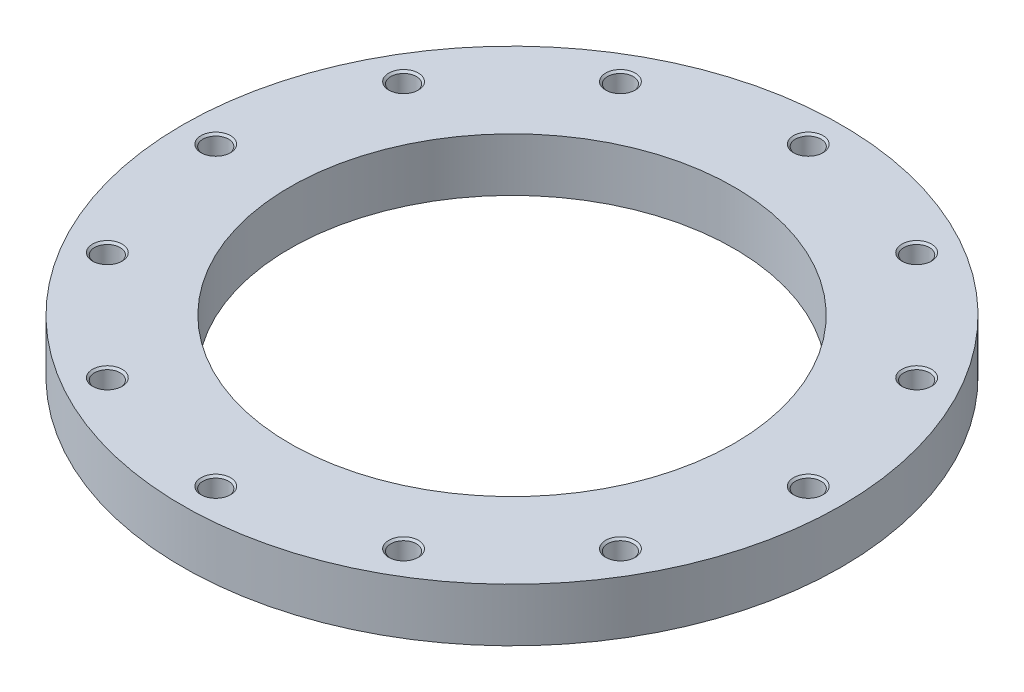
ISO-10303-21;
HEADER;
FILE_DESCRIPTION(('STEP AP214'),'2;1');
FILE_NAME('part.step','',(''),(''),'','','');
FILE_SCHEMA(('AUTOMOTIVE_DESIGN { 1 0 10303 214 1 1 1 1 }'));
ENDSEC;
DATA;
#1=APPLICATION_CONTEXT('core data for automotive mechanical design processes');
#2=APPLICATION_PROTOCOL_DEFINITION('international standard','automotive_design',2000,#1);
#3=PRODUCT_CONTEXT('',#1,'mechanical');
#4=PRODUCT('Part','Part','',(#3));
#5=PRODUCT_RELATED_PRODUCT_CATEGORY('part','',(#4));
#6=PRODUCT_DEFINITION_FORMATION('','',#4);
#7=PRODUCT_DEFINITION_CONTEXT('part definition',#1,'design');
#8=PRODUCT_DEFINITION('design','',#6,#7);
#9=PRODUCT_DEFINITION_SHAPE('','',#8);
#10=(LENGTH_UNIT() NAMED_UNIT(*) SI_UNIT(.MILLI.,.METRE.));
#11=(NAMED_UNIT(*) PLANE_ANGLE_UNIT() SI_UNIT($,.RADIAN.));
#12=(NAMED_UNIT(*) SI_UNIT($,.STERADIAN.) SOLID_ANGLE_UNIT());
#13=UNCERTAINTY_MEASURE_WITH_UNIT(LENGTH_MEASURE(1.E-05),#10,'distance_accuracy_value','');
#14=(GEOMETRIC_REPRESENTATION_CONTEXT(3) GLOBAL_UNCERTAINTY_ASSIGNED_CONTEXT((#13)) GLOBAL_UNIT_ASSIGNED_CONTEXT((#10,
#11,#12)) REPRESENTATION_CONTEXT('',''));
#15=CARTESIAN_POINT('',(0.,0.,0.));
#16=DIRECTION('',(0.,0.,1.));
#17=DIRECTION('',(1.,0.,0.));
#18=AXIS2_PLACEMENT_3D('',#15,#16,#17);
#19=CARTESIAN_POINT('',(0.,18.,0.));
#20=DIRECTION('',(0.,-1.,0.));
#21=DIRECTION('',(1.,0.,0.));
#22=AXIS2_PLACEMENT_3D('',#19,#20,#21);
#23=CYLINDRICAL_SURFACE('',#22,222.5);
#24=CARTESIAN_POINT('',(0.,0.,0.));
#25=DIRECTION('',(0.,1.,0.));
#26=DIRECTION('',(1.,0.,0.));
#27=AXIS2_PLACEMENT_3D('',#24,#25,#26);
#28=CIRCLE('',#27,222.5);
#29=CARTESIAN_POINT('',(222.5,0.,0.));
#30=VERTEX_POINT('',#29);
#31=EDGE_CURVE('E9',#30,#30,#28,.T.);
#32=ORIENTED_EDGE('',*,*,#31,.T.);
#33=EDGE_LOOP('',(#32));
#34=FACE_BOUND('',#33,.T.);
#35=CARTESIAN_POINT('',(0.,36.,0.));
#36=DIRECTION('',(0.,1.,0.));
#37=DIRECTION('',(1.,0.,0.));
#38=AXIS2_PLACEMENT_3D('',#35,#36,#37);
#39=CIRCLE('',#38,222.5);
#40=CARTESIAN_POINT('',(222.5,36.,0.));
#41=VERTEX_POINT('',#40);
#42=EDGE_CURVE('E139',#41,#41,#39,.T.);
#43=ORIENTED_EDGE('',*,*,#42,.F.);
#44=EDGE_LOOP('',(#43));
#45=FACE_BOUND('',#44,.T.);
#46=ADVANCED_FACE('F15',(#34,#45),#23,.T.);
#47=CARTESIAN_POINT('',(186.25,0.,0.));
#48=DIRECTION('',(0.,-1.,0.));
#49=DIRECTION('',(-1.,0.,0.));
#50=AXIS2_PLACEMENT_3D('',#47,#48,#49);
#51=PLANE('',#50);
#52=CARTESIAN_POINT('',(0.,0.,0.));
#53=DIRECTION('',(0.,1.,0.));
#54=DIRECTION('',(1.,0.,0.));
#55=AXIS2_PLACEMENT_3D('',#52,#53,#54);
#56=CIRCLE('',#55,150.);
#57=CARTESIAN_POINT('',(150.,0.,0.));
#58=VERTEX_POINT('',#57);
#59=EDGE_CURVE('E19',#58,#58,#56,.T.);
#60=ORIENTED_EDGE('',*,*,#59,.T.);
#61=EDGE_LOOP('',(#60));
#62=FACE_BOUND('',#61,.T.);
#63=ORIENTED_EDGE('',*,*,#31,.F.);
#64=EDGE_LOOP('',(#63));
#65=FACE_BOUND('',#64,.T.);
#66=ADVANCED_FACE('F17',(#62,#65),#51,.T.);
#67=CARTESIAN_POINT('',(0.,18.,0.));
#68=DIRECTION('',(0.,-1.,0.));
#69=DIRECTION('',(1.,0.,0.));
#70=AXIS2_PLACEMENT_3D('',#67,#68,#69);
#71=CYLINDRICAL_SURFACE('',#70,150.);
#72=CARTESIAN_POINT('',(0.,36.,0.));
#73=DIRECTION('',(0.,1.,0.));
#74=DIRECTION('',(1.,0.,0.));
#75=AXIS2_PLACEMENT_3D('',#72,#73,#74);
#76=CIRCLE('',#75,150.);
#77=CARTESIAN_POINT('',(150.,36.,0.));
#78=VERTEX_POINT('',#77);
#79=EDGE_CURVE('E134',#78,#78,#76,.T.);
#80=ORIENTED_EDGE('',*,*,#79,.T.);
#81=EDGE_LOOP('',(#80));
#82=FACE_BOUND('',#81,.T.);
#83=ORIENTED_EDGE('',*,*,#59,.F.);
#84=EDGE_LOOP('',(#83));
#85=FACE_BOUND('',#84,.T.);
#86=ADVANCED_FACE('F446',(#82,#85),#71,.F.);
#87=CARTESIAN_POINT('',(186.25,36.,0.));
#88=DIRECTION('',(0.,1.,0.));
#89=DIRECTION('',(1.,0.,0.));
#90=AXIS2_PLACEMENT_3D('',#87,#88,#89);
#91=PLANE('',#90);
#92=ORIENTED_EDGE('',*,*,#42,.T.);
#93=EDGE_LOOP('',(#92));
#94=FACE_BOUND('',#93,.T.);
#95=ORIENTED_EDGE('',*,*,#79,.F.);
#96=EDGE_LOOP('',(#95));
#97=FACE_BOUND('',#96,.T.);
#98=CARTESIAN_POINT('',(200.,36.,0.));
#99=DIRECTION('',(0.,-1.,0.));
#100=DIRECTION('',(1.,0.,0.));
#101=AXIS2_PLACEMENT_3D('',#98,#99,#100);
#102=CIRCLE('',#101,10.);
#103=CARTESIAN_POINT('',(210.,36.,0.));
#104=VERTEX_POINT('',#103);
#105=EDGE_CURVE('E339',#104,#104,#102,.T.);
#106=ORIENTED_EDGE('',*,*,#105,.T.);
#107=EDGE_LOOP('',(#106));
#108=FACE_BOUND('',#107,.T.);
#109=CARTESIAN_POINT('',(173.205080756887,36.,-100.));
#110=DIRECTION('',(0.,-1.,0.));
#111=DIRECTION('',(0.866025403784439,0.,-0.5));
#112=AXIS2_PLACEMENT_3D('',#109,#110,#111);
#113=CIRCLE('',#112,10.);
#114=CARTESIAN_POINT('',(181.865334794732,36.,-105.));
#115=VERTEX_POINT('',#114);
#116=EDGE_CURVE('E328',#115,#115,#113,.T.);
#117=ORIENTED_EDGE('',*,*,#116,.T.);
#118=EDGE_LOOP('',(#117));
#119=FACE_BOUND('',#118,.T.);
#120=CARTESIAN_POINT('',(100.,36.,-173.205080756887));
#121=DIRECTION('',(0.,-1.,0.));
#122=DIRECTION('',(0.5,0.,-0.866025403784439));
#123=AXIS2_PLACEMENT_3D('',#120,#121,#122);
#124=CIRCLE('',#123,10.);
#125=CARTESIAN_POINT('',(105.,36.,-181.865334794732));
#126=VERTEX_POINT('',#125);
#127=EDGE_CURVE('E316',#126,#126,#124,.T.);
#128=ORIENTED_EDGE('',*,*,#127,.T.);
#129=EDGE_LOOP('',(#128));
#130=FACE_BOUND('',#129,.T.);
#131=CARTESIAN_POINT('',(0.,36.,-200.));
#132=DIRECTION('',(0.,-1.,0.));
#133=DIRECTION('',(0.,0.,-1.));
#134=AXIS2_PLACEMENT_3D('',#131,#132,#133);
#135=CIRCLE('',#134,10.);
#136=CARTESIAN_POINT('',(0.,36.,-210.));
#137=VERTEX_POINT('',#136);
#138=EDGE_CURVE('E306',#137,#137,#135,.T.);
#139=ORIENTED_EDGE('',*,*,#138,.T.);
#140=EDGE_LOOP('',(#139));
#141=FACE_BOUND('',#140,.T.);
#142=CARTESIAN_POINT('',(-100.,36.,-173.205080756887));
#143=DIRECTION('',(0.,-1.,0.));
#144=DIRECTION('',(-0.5,0.,-0.866025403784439));
#145=AXIS2_PLACEMENT_3D('',#142,#143,#144);
#146=CIRCLE('',#145,10.);
#147=CARTESIAN_POINT('',(-105.,36.,-181.865334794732));
#148=VERTEX_POINT('',#147);
#149=EDGE_CURVE('E291',#148,#148,#146,.T.);
#150=ORIENTED_EDGE('',*,*,#149,.T.);
#151=EDGE_LOOP('',(#150));
#152=FACE_BOUND('',#151,.T.);
#153=CARTESIAN_POINT('',(-173.205080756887,36.,-100.));
#154=DIRECTION('',(0.,-1.,0.));
#155=DIRECTION('',(-0.866025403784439,0.,-0.5));
#156=AXIS2_PLACEMENT_3D('',#153,#154,#155);
#157=CIRCLE('',#156,10.);
#158=CARTESIAN_POINT('',(-181.865334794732,36.,-105.));
#159=VERTEX_POINT('',#158);
#160=EDGE_CURVE('E384',#159,#159,#157,.T.);
#161=ORIENTED_EDGE('',*,*,#160,.T.);
#162=EDGE_LOOP('',(#161));
#163=FACE_BOUND('',#162,.T.);
#164=CARTESIAN_POINT('',(-200.,36.,0.));
#165=DIRECTION('',(0.,-1.,0.));
#166=DIRECTION('',(-1.,0.,0.));
#167=AXIS2_PLACEMENT_3D('',#164,#165,#166);
#168=CIRCLE('',#167,10.);
#169=CARTESIAN_POINT('',(-210.,36.,0.));
#170=VERTEX_POINT('',#169);
#171=EDGE_CURVE('E407',#170,#170,#168,.T.);
#172=ORIENTED_EDGE('',*,*,#171,.T.);
#173=EDGE_LOOP('',(#172));
#174=FACE_BOUND('',#173,.T.);
#175=CARTESIAN_POINT('',(-173.205080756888,36.,100.));
#176=DIRECTION('',(0.,-1.,0.));
#177=DIRECTION('',(-0.866025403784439,0.,0.5));
#178=AXIS2_PLACEMENT_3D('',#175,#176,#177);
#179=CIRCLE('',#178,10.);
#180=CARTESIAN_POINT('',(-181.865334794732,36.,105.));
#181=VERTEX_POINT('',#180);
#182=EDGE_CURVE('E394',#181,#181,#179,.T.);
#183=ORIENTED_EDGE('',*,*,#182,.T.);
#184=EDGE_LOOP('',(#183));
#185=FACE_BOUND('',#184,.T.);
#186=CARTESIAN_POINT('',(-100.,36.,173.205080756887));
#187=DIRECTION('',(0.,-1.,0.));
#188=DIRECTION('',(-0.5,0.,0.866025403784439));
#189=AXIS2_PLACEMENT_3D('',#186,#187,#188);
#190=CIRCLE('',#189,10.);
#191=CARTESIAN_POINT('',(-105.,36.,181.865334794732));
#192=VERTEX_POINT('',#191);
#193=EDGE_CURVE('E379',#192,#192,#190,.T.);
#194=ORIENTED_EDGE('',*,*,#193,.T.);
#195=EDGE_LOOP('',(#194));
#196=FACE_BOUND('',#195,.T.);
#197=CARTESIAN_POINT('',(0.,36.,200.));
#198=DIRECTION('',(0.,-1.,0.));
#199=DIRECTION('',(0.,0.,1.));
#200=AXIS2_PLACEMENT_3D('',#197,#198,#199);
#201=CIRCLE('',#200,10.);
#202=CARTESIAN_POINT('',(0.,36.,210.));
#203=VERTEX_POINT('',#202);
#204=EDGE_CURVE('E359',#203,#203,#201,.T.);
#205=ORIENTED_EDGE('',*,*,#204,.T.);
#206=EDGE_LOOP('',(#205));
#207=FACE_BOUND('',#206,.T.);
#208=CARTESIAN_POINT('',(100.,36.,173.205080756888));
#209=DIRECTION('',(0.,-1.,0.));
#210=DIRECTION('',(0.5,0.,0.866025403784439));
#211=AXIS2_PLACEMENT_3D('',#208,#209,#210);
#212=CIRCLE('',#211,10.);
#213=CARTESIAN_POINT('',(105.,36.,181.865334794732));
#214=VERTEX_POINT('',#213);
#215=EDGE_CURVE('E364',#214,#214,#212,.T.);
#216=ORIENTED_EDGE('',*,*,#215,.T.);
#217=EDGE_LOOP('',(#216));
#218=FACE_BOUND('',#217,.T.);
#219=CARTESIAN_POINT('',(173.205080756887,36.,100.));
#220=DIRECTION('',(0.,-1.,0.));
#221=DIRECTION('',(0.866025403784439,0.,0.5));
#222=AXIS2_PLACEMENT_3D('',#219,#220,#221);
#223=CIRCLE('',#222,10.);
#224=CARTESIAN_POINT('',(181.865334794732,36.,105.));
#225=VERTEX_POINT('',#224);
#226=EDGE_CURVE('E1218',#225,#225,#223,.T.);
#227=ORIENTED_EDGE('',*,*,#226,.T.);
#228=EDGE_LOOP('',(#227));
#229=FACE_BOUND('',#228,.T.);
#230=ADVANCED_FACE('F1128',(#94,#97,#108,#119,#130,#141,#152,#163,#174,#185,#196,#207,#218,
#229),#91,.T.);
#231=CARTESIAN_POINT('',(200.,5.50386219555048,0.));
#232=DIRECTION('',(0.,1.,0.));
#233=DIRECTION('',(1.,0.,0.));
#234=AXIS2_PLACEMENT_3D('',#231,#232,#233);
#235=CONICAL_SURFACE('',#234,4.3234375,1.0471975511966);
#236=CARTESIAN_POINT('',(200.,8.,0.));
#237=DIRECTION('',(0.,-1.,0.));
#238=DIRECTION('',(1.,0.,0.));
#239=AXIS2_PLACEMENT_3D('',#236,#237,#238);
#240=CIRCLE('',#239,8.646875);
#241=CARTESIAN_POINT('',(208.646875,8.,0.));
#242=VERTEX_POINT('',#241);
#243=EDGE_CURVE('E130',#242,#242,#240,.T.);
#244=ORIENTED_EDGE('',*,*,#243,.F.);
#245=EDGE_LOOP('',(#244));
#246=FACE_BOUND('',#245,.T.);
#247=CARTESIAN_POINT('',(200.,3.00772439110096,0.));
#248=VERTEX_POINT('',#247);
#249=VERTEX_LOOP('',#248);
#250=FACE_BOUND('',#249,.T.);
#251=ADVANCED_FACE('F1119',(#246,#250),#235,.F.);
#252=CARTESIAN_POINT('',(200.,11.3234375,0.));
#253=DIRECTION('',(0.,1.,0.));
#254=DIRECTION('',(1.,0.,0.));
#255=AXIS2_PLACEMENT_3D('',#252,#253,#254);
#256=CYLINDRICAL_SURFACE('',#255,8.646875);
#257=CARTESIAN_POINT('',(200.,14.646875,0.));
#258=DIRECTION('',(0.,-1.,0.));
#259=DIRECTION('',(1.,0.,0.));
#260=AXIS2_PLACEMENT_3D('',#257,#258,#259);
#261=CIRCLE('',#260,8.646875);
#262=CARTESIAN_POINT('',(208.646875,14.646875,0.));
#263=VERTEX_POINT('',#262);
#264=EDGE_CURVE('E345',#263,#263,#261,.T.);
#265=ORIENTED_EDGE('',*,*,#264,.F.);
#266=EDGE_LOOP('',(#265));
#267=FACE_BOUND('',#266,.T.);
#268=ORIENTED_EDGE('',*,*,#243,.T.);
#269=EDGE_LOOP('',(#268));
#270=FACE_BOUND('',#269,.T.);
#271=ADVANCED_FACE('F1110',(#267,#270),#256,.F.);
#272=CARTESIAN_POINT('',(200.,15.3234375,0.));
#273=DIRECTION('',(0.,1.,0.));
#274=DIRECTION('',(1.,0.,0.));
#275=AXIS2_PLACEMENT_3D('',#272,#273,#274);
#276=CONICAL_SURFACE('',#275,9.3234375,0.785398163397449);
#277=CARTESIAN_POINT('',(200.,16.,0.));
#278=DIRECTION('',(0.,-1.,0.));
#279=DIRECTION('',(1.,0.,0.));
#280=AXIS2_PLACEMENT_3D('',#277,#278,#279);
#281=CIRCLE('',#280,10.);
#282=CARTESIAN_POINT('',(210.,16.,0.));
#283=VERTEX_POINT('',#282);
#284=EDGE_CURVE('E343',#283,#283,#281,.T.);
#285=ORIENTED_EDGE('',*,*,#284,.F.);
#286=EDGE_LOOP('',(#285));
#287=FACE_BOUND('',#286,.T.);
#288=ORIENTED_EDGE('',*,*,#264,.T.);
#289=EDGE_LOOP('',(#288));
#290=FACE_BOUND('',#289,.T.);
#291=ADVANCED_FACE('F1101',(#287,#290),#276,.F.);
#292=CARTESIAN_POINT('',(209.3234375,16.,0.));
#293=DIRECTION('',(0.,1.,0.));
#294=DIRECTION('',(-1.,0.,0.));
#295=AXIS2_PLACEMENT_3D('',#292,#293,#294);
#296=PLANE('',#295);
#297=CARTESIAN_POINT('',(200.,16.,0.));
#298=DIRECTION('',(0.,-1.,0.));
#299=DIRECTION('',(1.,0.,0.));
#300=AXIS2_PLACEMENT_3D('',#297,#298,#299);
#301=CIRCLE('',#300,8.646875);
#302=CARTESIAN_POINT('',(208.646875,16.,0.));
#303=VERTEX_POINT('',#302);
#304=EDGE_CURVE('E341',#303,#303,#301,.T.);
#305=ORIENTED_EDGE('',*,*,#304,.F.);
#306=EDGE_LOOP('',(#305));
#307=FACE_BOUND('',#306,.T.);
#308=ORIENTED_EDGE('',*,*,#284,.T.);
#309=EDGE_LOOP('',(#308));
#310=FACE_BOUND('',#309,.T.);
#311=ADVANCED_FACE('F1092',(#307,#310),#296,.F.);
#312=CARTESIAN_POINT('',(200.,25.3234375,0.));
#313=DIRECTION('',(0.,1.,0.));
#314=DIRECTION('',(1.,0.,0.));
#315=AXIS2_PLACEMENT_3D('',#312,#313,#314);
#316=CYLINDRICAL_SURFACE('',#315,8.646875);
#317=CARTESIAN_POINT('',(200.,34.646875,0.));
#318=DIRECTION('',(0.,-1.,0.));
#319=DIRECTION('',(1.,0.,0.));
#320=AXIS2_PLACEMENT_3D('',#317,#318,#319);
#321=CIRCLE('',#320,8.646875);
#322=CARTESIAN_POINT('',(208.646875,34.646875,0.));
#323=VERTEX_POINT('',#322);
#324=EDGE_CURVE('E338',#323,#323,#321,.T.);
#325=ORIENTED_EDGE('',*,*,#324,.F.);
#326=EDGE_LOOP('',(#325));
#327=FACE_BOUND('',#326,.T.);
#328=ORIENTED_EDGE('',*,*,#304,.T.);
#329=EDGE_LOOP('',(#328));
#330=FACE_BOUND('',#329,.T.);
#331=ADVANCED_FACE('F1083',(#327,#330),#316,.F.);
#332=CARTESIAN_POINT('',(200.,35.3234375,0.));
#333=DIRECTION('',(0.,1.,0.));
#334=DIRECTION('',(1.,0.,0.));
#335=AXIS2_PLACEMENT_3D('',#332,#333,#334);
#336=CONICAL_SURFACE('',#335,9.3234375,0.785398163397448);
#337=ORIENTED_EDGE('',*,*,#105,.F.);
#338=EDGE_LOOP('',(#337));
#339=FACE_BOUND('',#338,.T.);
#340=ORIENTED_EDGE('',*,*,#324,.T.);
#341=EDGE_LOOP('',(#340));
#342=FACE_BOUND('',#341,.T.);
#343=ADVANCED_FACE('F1074',(#339,#342),#336,.F.);
#344=CARTESIAN_POINT('',(173.205080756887,5.50386219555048,-100.));
#345=DIRECTION('',(0.,1.,0.));
#346=DIRECTION('',(0.866025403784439,0.,-0.5));
#347=AXIS2_PLACEMENT_3D('',#344,#345,#346);
#348=CONICAL_SURFACE('',#347,4.3234375,1.0471975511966);
#349=CARTESIAN_POINT('',(173.205080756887,8.,-100.));
#350=DIRECTION('',(0.,-1.,0.));
#351=DIRECTION('',(0.866025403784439,0.,-0.5));
#352=AXIS2_PLACEMENT_3D('',#349,#350,#351);
#353=CIRCLE('',#352,8.646875);
#354=CARTESIAN_POINT('',(180.693494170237,8.,-104.3234375));
#355=VERTEX_POINT('',#354);
#356=EDGE_CURVE('E336',#355,#355,#353,.T.);
#357=ORIENTED_EDGE('',*,*,#356,.F.);
#358=EDGE_LOOP('',(#357));
#359=FACE_BOUND('',#358,.T.);
#360=CARTESIAN_POINT('',(173.205080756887,3.00772439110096,-100.));
#361=VERTEX_POINT('',#360);
#362=VERTEX_LOOP('',#361);
#363=FACE_BOUND('',#362,.T.);
#364=ADVANCED_FACE('F1065',(#359,#363),#348,.F.);
#365=CARTESIAN_POINT('',(173.205080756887,11.3234375,-100.));
#366=DIRECTION('',(0.,1.,0.));
#367=DIRECTION('',(0.866025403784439,0.,-0.5));
#368=AXIS2_PLACEMENT_3D('',#365,#366,#367);
#369=CYLINDRICAL_SURFACE('',#368,8.646875);
#370=CARTESIAN_POINT('',(173.205080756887,14.646875,-100.));
#371=DIRECTION('',(0.,-1.,0.));
#372=DIRECTION('',(0.866025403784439,0.,-0.5));
#373=AXIS2_PLACEMENT_3D('',#370,#371,#372);
#374=CIRCLE('',#373,8.646875);
#375=CARTESIAN_POINT('',(180.693494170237,14.646875,-104.3234375));
#376=VERTEX_POINT('',#375);
#377=EDGE_CURVE('E334',#376,#376,#374,.T.);
#378=ORIENTED_EDGE('',*,*,#377,.F.);
#379=EDGE_LOOP('',(#378));
#380=FACE_BOUND('',#379,.T.);
#381=ORIENTED_EDGE('',*,*,#356,.T.);
#382=EDGE_LOOP('',(#381));
#383=FACE_BOUND('',#382,.T.);
#384=ADVANCED_FACE('F1056',(#380,#383),#369,.F.);
#385=CARTESIAN_POINT('',(173.205080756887,15.3234375,-100.));
#386=DIRECTION('',(0.,1.,0.));
#387=DIRECTION('',(0.866025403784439,0.,-0.5));
#388=AXIS2_PLACEMENT_3D('',#385,#386,#387);
#389=CONICAL_SURFACE('',#388,9.3234375,0.785398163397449);
#390=CARTESIAN_POINT('',(173.205080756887,16.,-100.));
#391=DIRECTION('',(0.,-1.,0.));
#392=DIRECTION('',(0.866025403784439,0.,-0.5));
#393=AXIS2_PLACEMENT_3D('',#390,#391,#392);
#394=CIRCLE('',#393,10.);
#395=CARTESIAN_POINT('',(181.865334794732,16.,-105.));
#396=VERTEX_POINT('',#395);
#397=EDGE_CURVE('E332',#396,#396,#394,.T.);
#398=ORIENTED_EDGE('',*,*,#397,.F.);
#399=EDGE_LOOP('',(#398));
#400=FACE_BOUND('',#399,.T.);
#401=ORIENTED_EDGE('',*,*,#377,.T.);
#402=EDGE_LOOP('',(#401));
#403=FACE_BOUND('',#402,.T.);
#404=ADVANCED_FACE('F1047',(#400,#403),#389,.F.);
#405=CARTESIAN_POINT('',(181.279414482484,16.,-104.66171875));
#406=DIRECTION('',(0.,1.,0.));
#407=DIRECTION('',(-0.866025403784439,0.,0.5));
#408=AXIS2_PLACEMENT_3D('',#405,#406,#407);
#409=PLANE('',#408);
#410=CARTESIAN_POINT('',(173.205080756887,16.,-100.));
#411=DIRECTION('',(0.,-1.,0.));
#412=DIRECTION('',(0.866025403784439,0.,-0.5));
#413=AXIS2_PLACEMENT_3D('',#410,#411,#412);
#414=CIRCLE('',#413,8.646875);
#415=CARTESIAN_POINT('',(180.693494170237,16.,-104.3234375));
#416=VERTEX_POINT('',#415);
#417=EDGE_CURVE('E330',#416,#416,#414,.T.);
#418=ORIENTED_EDGE('',*,*,#417,.F.);
#419=EDGE_LOOP('',(#418));
#420=FACE_BOUND('',#419,.T.);
#421=ORIENTED_EDGE('',*,*,#397,.T.);
#422=EDGE_LOOP('',(#421));
#423=FACE_BOUND('',#422,.T.);
#424=ADVANCED_FACE('F1038',(#420,#423),#409,.F.);
#425=CARTESIAN_POINT('',(173.205080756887,25.3234375,-100.));
#426=DIRECTION('',(0.,1.,0.));
#427=DIRECTION('',(0.866025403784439,0.,-0.5));
#428=AXIS2_PLACEMENT_3D('',#425,#426,#427);
#429=CYLINDRICAL_SURFACE('',#428,8.646875);
#430=CARTESIAN_POINT('',(173.205080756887,34.646875,-100.));
#431=DIRECTION('',(0.,-1.,0.));
#432=DIRECTION('',(0.866025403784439,0.,-0.5));
#433=AXIS2_PLACEMENT_3D('',#430,#431,#432);
#434=CIRCLE('',#433,8.646875);
#435=CARTESIAN_POINT('',(180.693494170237,34.646875,-104.3234375));
#436=VERTEX_POINT('',#435);
#437=EDGE_CURVE('E326',#436,#436,#434,.T.);
#438=ORIENTED_EDGE('',*,*,#437,.F.);
#439=EDGE_LOOP('',(#438));
#440=FACE_BOUND('',#439,.T.);
#441=ORIENTED_EDGE('',*,*,#417,.T.);
#442=EDGE_LOOP('',(#441));
#443=FACE_BOUND('',#442,.T.);
#444=ADVANCED_FACE('F1029',(#440,#443),#429,.F.);
#445=CARTESIAN_POINT('',(173.205080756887,35.3234375,-100.));
#446=DIRECTION('',(0.,1.,0.));
#447=DIRECTION('',(0.866025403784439,0.,-0.5));
#448=AXIS2_PLACEMENT_3D('',#445,#446,#447);
#449=CONICAL_SURFACE('',#448,9.3234375,0.785398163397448);
#450=ORIENTED_EDGE('',*,*,#116,.F.);
#451=EDGE_LOOP('',(#450));
#452=FACE_BOUND('',#451,.T.);
#453=ORIENTED_EDGE('',*,*,#437,.T.);
#454=EDGE_LOOP('',(#453));
#455=FACE_BOUND('',#454,.T.);
#456=ADVANCED_FACE('F1020',(#452,#455),#449,.F.);
#457=CARTESIAN_POINT('',(100.,5.50386219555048,-173.205080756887));
#458=DIRECTION('',(0.,1.,0.));
#459=DIRECTION('',(0.5,0.,-0.866025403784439));
#460=AXIS2_PLACEMENT_3D('',#457,#458,#459);
#461=CONICAL_SURFACE('',#460,4.3234375,1.0471975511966);
#462=CARTESIAN_POINT('',(100.,8.,-173.205080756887));
#463=DIRECTION('',(0.,-1.,0.));
#464=DIRECTION('',(0.5,0.,-0.866025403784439));
#465=AXIS2_PLACEMENT_3D('',#462,#463,#464);
#466=CIRCLE('',#465,8.646875);
#467=CARTESIAN_POINT('',(104.3234375,8.,-180.693494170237));
#468=VERTEX_POINT('',#467);
#469=EDGE_CURVE('E324',#468,#468,#466,.T.);
#470=ORIENTED_EDGE('',*,*,#469,.F.);
#471=EDGE_LOOP('',(#470));
#472=FACE_BOUND('',#471,.T.);
#473=CARTESIAN_POINT('',(100.,3.00772439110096,-173.205080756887));
#474=VERTEX_POINT('',#473);
#475=VERTEX_LOOP('',#474);
#476=FACE_BOUND('',#475,.T.);
#477=ADVANCED_FACE('F1011',(#472,#476),#461,.F.);
#478=CARTESIAN_POINT('',(100.,11.3234375,-173.205080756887));
#479=DIRECTION('',(0.,1.,0.));
#480=DIRECTION('',(0.5,0.,-0.866025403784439));
#481=AXIS2_PLACEMENT_3D('',#478,#479,#480);
#482=CYLINDRICAL_SURFACE('',#481,8.646875);
#483=CARTESIAN_POINT('',(100.,14.646875,-173.205080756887));
#484=DIRECTION('',(0.,-1.,0.));
#485=DIRECTION('',(0.5,0.,-0.866025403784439));
#486=AXIS2_PLACEMENT_3D('',#483,#484,#485);
#487=CIRCLE('',#486,8.646875);
#488=CARTESIAN_POINT('',(104.3234375,14.646875,-180.693494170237));
#489=VERTEX_POINT('',#488);
#490=EDGE_CURVE('E322',#489,#489,#487,.T.);
#491=ORIENTED_EDGE('',*,*,#490,.F.);
#492=EDGE_LOOP('',(#491));
#493=FACE_BOUND('',#492,.T.);
#494=ORIENTED_EDGE('',*,*,#469,.T.);
#495=EDGE_LOOP('',(#494));
#496=FACE_BOUND('',#495,.T.);
#497=ADVANCED_FACE('F1002',(#493,#496),#482,.F.);
#498=CARTESIAN_POINT('',(100.,15.3234375,-173.205080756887));
#499=DIRECTION('',(0.,1.,0.));
#500=DIRECTION('',(0.5,0.,-0.866025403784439));
#501=AXIS2_PLACEMENT_3D('',#498,#499,#500);
#502=CONICAL_SURFACE('',#501,9.3234375,0.785398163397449);
#503=CARTESIAN_POINT('',(100.,16.,-173.205080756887));
#504=DIRECTION('',(0.,-1.,0.));
#505=DIRECTION('',(0.5,0.,-0.866025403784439));
#506=AXIS2_PLACEMENT_3D('',#503,#504,#505);
#507=CIRCLE('',#506,10.);
#508=CARTESIAN_POINT('',(105.,16.,-181.865334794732));
#509=VERTEX_POINT('',#508);
#510=EDGE_CURVE('E320',#509,#509,#507,.T.);
#511=ORIENTED_EDGE('',*,*,#510,.F.);
#512=EDGE_LOOP('',(#511));
#513=FACE_BOUND('',#512,.T.);
#514=ORIENTED_EDGE('',*,*,#490,.T.);
#515=EDGE_LOOP('',(#514));
#516=FACE_BOUND('',#515,.T.);
#517=ADVANCED_FACE('F993',(#513,#516),#502,.F.);
#518=CARTESIAN_POINT('',(104.66171875,16.,-181.279414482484));
#519=DIRECTION('',(0.,1.,0.));
#520=DIRECTION('',(-0.5,0.,0.866025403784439));
#521=AXIS2_PLACEMENT_3D('',#518,#519,#520);
#522=PLANE('',#521);
#523=CARTESIAN_POINT('',(100.,16.,-173.205080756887));
#524=DIRECTION('',(0.,-1.,0.));
#525=DIRECTION('',(0.5,0.,-0.866025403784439));
#526=AXIS2_PLACEMENT_3D('',#523,#524,#525);
#527=CIRCLE('',#526,8.646875);
#528=CARTESIAN_POINT('',(104.3234375,16.,-180.693494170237));
#529=VERTEX_POINT('',#528);
#530=EDGE_CURVE('E318',#529,#529,#527,.T.);
#531=ORIENTED_EDGE('',*,*,#530,.F.);
#532=EDGE_LOOP('',(#531));
#533=FACE_BOUND('',#532,.T.);
#534=ORIENTED_EDGE('',*,*,#510,.T.);
#535=EDGE_LOOP('',(#534));
#536=FACE_BOUND('',#535,.T.);
#537=ADVANCED_FACE('F984',(#533,#536),#522,.F.);
#538=CARTESIAN_POINT('',(100.,25.3234375,-173.205080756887));
#539=DIRECTION('',(0.,1.,0.));
#540=DIRECTION('',(0.5,0.,-0.866025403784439));
#541=AXIS2_PLACEMENT_3D('',#538,#539,#540);
#542=CYLINDRICAL_SURFACE('',#541,8.646875);
#543=CARTESIAN_POINT('',(100.,34.646875,-173.205080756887));
#544=DIRECTION('',(0.,-1.,0.));
#545=DIRECTION('',(0.5,0.,-0.866025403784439));
#546=AXIS2_PLACEMENT_3D('',#543,#544,#545);
#547=CIRCLE('',#546,8.646875);
#548=CARTESIAN_POINT('',(104.3234375,34.646875,-180.693494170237));
#549=VERTEX_POINT('',#548);
#550=EDGE_CURVE('E314',#549,#549,#547,.T.);
#551=ORIENTED_EDGE('',*,*,#550,.F.);
#552=EDGE_LOOP('',(#551));
#553=FACE_BOUND('',#552,.T.);
#554=ORIENTED_EDGE('',*,*,#530,.T.);
#555=EDGE_LOOP('',(#554));
#556=FACE_BOUND('',#555,.T.);
#557=ADVANCED_FACE('F975',(#553,#556),#542,.F.);
#558=CARTESIAN_POINT('',(100.,35.3234375,-173.205080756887));
#559=DIRECTION('',(0.,1.,0.));
#560=DIRECTION('',(0.5,0.,-0.866025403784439));
#561=AXIS2_PLACEMENT_3D('',#558,#559,#560);
#562=CONICAL_SURFACE('',#561,9.3234375,0.785398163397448);
#563=ORIENTED_EDGE('',*,*,#127,.F.);
#564=EDGE_LOOP('',(#563));
#565=FACE_BOUND('',#564,.T.);
#566=ORIENTED_EDGE('',*,*,#550,.T.);
#567=EDGE_LOOP('',(#566));
#568=FACE_BOUND('',#567,.T.);
#569=ADVANCED_FACE('F966',(#565,#568),#562,.F.);
#570=CARTESIAN_POINT('',(0.,5.50386219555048,-200.));
#571=DIRECTION('',(0.,1.,0.));
#572=DIRECTION('',(0.,0.,-1.));
#573=AXIS2_PLACEMENT_3D('',#570,#571,#572);
#574=CONICAL_SURFACE('',#573,4.3234375,1.0471975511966);
#575=CARTESIAN_POINT('',(0.,8.,-200.));
#576=DIRECTION('',(0.,-1.,0.));
#577=DIRECTION('',(0.,0.,-1.));
#578=AXIS2_PLACEMENT_3D('',#575,#576,#577);
#579=CIRCLE('',#578,8.646875);
#580=CARTESIAN_POINT('',(0.,8.,-208.646875));
#581=VERTEX_POINT('',#580);
#582=EDGE_CURVE('E313',#581,#581,#579,.T.);
#583=ORIENTED_EDGE('',*,*,#582,.F.);
#584=EDGE_LOOP('',(#583));
#585=FACE_BOUND('',#584,.T.);
#586=CARTESIAN_POINT('',(0.,3.00772439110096,-200.));
#587=VERTEX_POINT('',#586);
#588=VERTEX_LOOP('',#587);
#589=FACE_BOUND('',#588,.T.);
#590=ADVANCED_FACE('F480',(#585,#589),#574,.F.);
#591=CARTESIAN_POINT('',(0.,11.3234375,-200.));
#592=DIRECTION('',(0.,1.,0.));
#593=DIRECTION('',(0.,0.,-1.));
#594=AXIS2_PLACEMENT_3D('',#591,#592,#593);
#595=CYLINDRICAL_SURFACE('',#594,8.646875);
#596=CARTESIAN_POINT('',(0.,14.646875,-200.));
#597=DIRECTION('',(0.,-1.,0.));
#598=DIRECTION('',(0.,0.,-1.));
#599=AXIS2_PLACEMENT_3D('',#596,#597,#598);
#600=CIRCLE('',#599,8.646875);
#601=CARTESIAN_POINT('',(0.,14.646875,-208.646875));
#602=VERTEX_POINT('',#601);
#603=EDGE_CURVE('E311',#602,#602,#600,.T.);
#604=ORIENTED_EDGE('',*,*,#603,.F.);
#605=EDGE_LOOP('',(#604));
#606=FACE_BOUND('',#605,.T.);
#607=ORIENTED_EDGE('',*,*,#582,.T.);
#608=EDGE_LOOP('',(#607));
#609=FACE_BOUND('',#608,.T.);
#610=ADVANCED_FACE('F476',(#606,#609),#595,.F.);
#611=CARTESIAN_POINT('',(0.,15.3234375,-200.));
#612=DIRECTION('',(0.,1.,0.));
#613=DIRECTION('',(0.,0.,-1.));
#614=AXIS2_PLACEMENT_3D('',#611,#612,#613);
#615=CONICAL_SURFACE('',#614,9.3234375,0.785398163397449);
#616=CARTESIAN_POINT('',(0.,16.,-200.));
#617=DIRECTION('',(0.,-1.,0.));
#618=DIRECTION('',(0.,0.,-1.));
#619=AXIS2_PLACEMENT_3D('',#616,#617,#618);
#620=CIRCLE('',#619,10.);
#621=CARTESIAN_POINT('',(0.,16.,-210.));
#622=VERTEX_POINT('',#621);
#623=EDGE_CURVE('E309',#622,#622,#620,.T.);
#624=ORIENTED_EDGE('',*,*,#623,.F.);
#625=EDGE_LOOP('',(#624));
#626=FACE_BOUND('',#625,.T.);
#627=ORIENTED_EDGE('',*,*,#603,.T.);
#628=EDGE_LOOP('',(#627));
#629=FACE_BOUND('',#628,.T.);
#630=ADVANCED_FACE('F479',(#626,#629),#615,.F.);
#631=CARTESIAN_POINT('',(0.,16.,-209.3234375));
#632=DIRECTION('',(0.,1.,0.));
#633=DIRECTION('',(0.,0.,1.));
#634=AXIS2_PLACEMENT_3D('',#631,#632,#633);
#635=PLANE('',#634);
#636=CARTESIAN_POINT('',(0.,16.,-200.));
#637=DIRECTION('',(0.,-1.,0.));
#638=DIRECTION('',(0.,0.,-1.));
#639=AXIS2_PLACEMENT_3D('',#636,#637,#638);
#640=CIRCLE('',#639,8.646875);
#641=CARTESIAN_POINT('',(0.,16.,-208.646875));
#642=VERTEX_POINT('',#641);
#643=EDGE_CURVE('E307',#642,#642,#640,.T.);
#644=ORIENTED_EDGE('',*,*,#643,.F.);
#645=EDGE_LOOP('',(#644));
#646=FACE_BOUND('',#645,.T.);
#647=ORIENTED_EDGE('',*,*,#623,.T.);
#648=EDGE_LOOP('',(#647));
#649=FACE_BOUND('',#648,.T.);
#650=ADVANCED_FACE('F936',(#646,#649),#635,.F.);
#651=CARTESIAN_POINT('',(0.,25.3234375,-200.));
#652=DIRECTION('',(0.,1.,0.));
#653=DIRECTION('',(0.,0.,-1.));
#654=AXIS2_PLACEMENT_3D('',#651,#652,#653);
#655=CYLINDRICAL_SURFACE('',#654,8.646875);
#656=CARTESIAN_POINT('',(0.,34.646875,-200.));
#657=DIRECTION('',(0.,-1.,0.));
#658=DIRECTION('',(0.,0.,-1.));
#659=AXIS2_PLACEMENT_3D('',#656,#657,#658);
#660=CIRCLE('',#659,8.646875);
#661=CARTESIAN_POINT('',(0.,34.646875,-208.646875));
#662=VERTEX_POINT('',#661);
#663=EDGE_CURVE('E304',#662,#662,#660,.T.);
#664=ORIENTED_EDGE('',*,*,#663,.F.);
#665=EDGE_LOOP('',(#664));
#666=FACE_BOUND('',#665,.T.);
#667=ORIENTED_EDGE('',*,*,#643,.T.);
#668=EDGE_LOOP('',(#667));
#669=FACE_BOUND('',#668,.T.);
#670=ADVANCED_FACE('F457',(#666,#669),#655,.F.);
#671=CARTESIAN_POINT('',(0.,35.3234375,-200.));
#672=DIRECTION('',(0.,1.,0.));
#673=DIRECTION('',(0.,0.,-1.));
#674=AXIS2_PLACEMENT_3D('',#671,#672,#673);
#675=CONICAL_SURFACE('',#674,9.3234375,0.785398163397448);
#676=ORIENTED_EDGE('',*,*,#138,.F.);
#677=EDGE_LOOP('',(#676));
#678=FACE_BOUND('',#677,.T.);
#679=ORIENTED_EDGE('',*,*,#663,.T.);
#680=EDGE_LOOP('',(#679));
#681=FACE_BOUND('',#680,.T.);
#682=ADVANCED_FACE('F453',(#678,#681),#675,.F.);
#683=CARTESIAN_POINT('',(-100.,5.50386219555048,-173.205080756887));
#684=DIRECTION('',(0.,1.,0.));
#685=DIRECTION('',(-0.5,0.,-0.866025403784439));
#686=AXIS2_PLACEMENT_3D('',#683,#684,#685);
#687=CONICAL_SURFACE('',#686,4.3234375,1.0471975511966);
#688=CARTESIAN_POINT('',(-100.,8.,-173.205080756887));
#689=DIRECTION('',(0.,-1.,0.));
#690=DIRECTION('',(-0.5,0.,-0.866025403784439));
#691=AXIS2_PLACEMENT_3D('',#688,#689,#690);
#692=CIRCLE('',#691,8.646875);
#693=CARTESIAN_POINT('',(-104.3234375,8.,-180.693494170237));
#694=VERTEX_POINT('',#693);
#695=EDGE_CURVE('E303',#694,#694,#692,.T.);
#696=ORIENTED_EDGE('',*,*,#695,.F.);
#697=EDGE_LOOP('',(#696));
#698=FACE_BOUND('',#697,.T.);
#699=CARTESIAN_POINT('',(-100.,3.00772439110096,-173.205080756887));
#700=VERTEX_POINT('',#699);
#701=VERTEX_LOOP('',#700);
#702=FACE_BOUND('',#701,.T.);
#703=ADVANCED_FACE('F456',(#698,#702),#687,.F.);
#704=CARTESIAN_POINT('',(-100.,11.3234375,-173.205080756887));
#705=DIRECTION('',(0.,1.,0.));
#706=DIRECTION('',(-0.5,0.,-0.866025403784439));
#707=AXIS2_PLACEMENT_3D('',#704,#705,#706);
#708=CYLINDRICAL_SURFACE('',#707,8.646875);
#709=CARTESIAN_POINT('',(-100.,14.646875,-173.205080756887));
#710=DIRECTION('',(0.,-1.,0.));
#711=DIRECTION('',(-0.5,0.,-0.866025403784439));
#712=AXIS2_PLACEMENT_3D('',#709,#710,#711);
#713=CIRCLE('',#712,8.646875);
#714=CARTESIAN_POINT('',(-104.3234375,14.646875,-180.693494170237));
#715=VERTEX_POINT('',#714);
#716=EDGE_CURVE('E301',#715,#715,#713,.T.);
#717=ORIENTED_EDGE('',*,*,#716,.F.);
#718=EDGE_LOOP('',(#717));
#719=FACE_BOUND('',#718,.T.);
#720=ORIENTED_EDGE('',*,*,#695,.T.);
#721=EDGE_LOOP('',(#720));
#722=FACE_BOUND('',#721,.T.);
#723=ADVANCED_FACE('F906',(#719,#722),#708,.F.);
#724=CARTESIAN_POINT('',(-100.,15.3234375,-173.205080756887));
#725=DIRECTION('',(0.,1.,0.));
#726=DIRECTION('',(-0.5,0.,-0.866025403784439));
#727=AXIS2_PLACEMENT_3D('',#724,#725,#726);
#728=CONICAL_SURFACE('',#727,9.3234375,0.785398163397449);
#729=CARTESIAN_POINT('',(-100.,16.,-173.205080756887));
#730=DIRECTION('',(0.,-1.,0.));
#731=DIRECTION('',(-0.5,0.,-0.866025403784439));
#732=AXIS2_PLACEMENT_3D('',#729,#730,#731);
#733=CIRCLE('',#732,10.);
#734=CARTESIAN_POINT('',(-105.,16.,-181.865334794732));
#735=VERTEX_POINT('',#734);
#736=EDGE_CURVE('E299',#735,#735,#733,.T.);
#737=ORIENTED_EDGE('',*,*,#736,.F.);
#738=EDGE_LOOP('',(#737));
#739=FACE_BOUND('',#738,.T.);
#740=ORIENTED_EDGE('',*,*,#716,.T.);
#741=EDGE_LOOP('',(#740));
#742=FACE_BOUND('',#741,.T.);
#743=ADVANCED_FACE('F897',(#739,#742),#728,.F.);
#744=CARTESIAN_POINT('',(-104.66171875,16.,-181.279414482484));
#745=DIRECTION('',(0.,1.,0.));
#746=DIRECTION('',(0.5,0.,0.866025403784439));
#747=AXIS2_PLACEMENT_3D('',#744,#745,#746);
#748=PLANE('',#747);
#749=CARTESIAN_POINT('',(-100.,16.,-173.205080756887));
#750=DIRECTION('',(0.,-1.,0.));
#751=DIRECTION('',(-0.5,0.,-0.866025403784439));
#752=AXIS2_PLACEMENT_3D('',#749,#750,#751);
#753=CIRCLE('',#752,8.646875);
#754=CARTESIAN_POINT('',(-104.3234375,16.,-180.693494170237));
#755=VERTEX_POINT('',#754);
#756=EDGE_CURVE('E297',#755,#755,#753,.T.);
#757=ORIENTED_EDGE('',*,*,#756,.F.);
#758=EDGE_LOOP('',(#757));
#759=FACE_BOUND('',#758,.T.);
#760=ORIENTED_EDGE('',*,*,#736,.T.);
#761=EDGE_LOOP('',(#760));
#762=FACE_BOUND('',#761,.T.);
#763=ADVANCED_FACE('F888',(#759,#762),#748,.F.);
#764=CARTESIAN_POINT('',(-100.,25.3234375,-173.205080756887));
#765=DIRECTION('',(0.,1.,0.));
#766=DIRECTION('',(-0.5,0.,-0.866025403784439));
#767=AXIS2_PLACEMENT_3D('',#764,#765,#766);
#768=CYLINDRICAL_SURFACE('',#767,8.646875);
#769=CARTESIAN_POINT('',(-100.,34.646875,-173.205080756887));
#770=DIRECTION('',(0.,-1.,0.));
#771=DIRECTION('',(-0.5,0.,-0.866025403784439));
#772=AXIS2_PLACEMENT_3D('',#769,#770,#771);
#773=CIRCLE('',#772,8.646875);
#774=CARTESIAN_POINT('',(-104.3234375,34.646875,-180.693494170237));
#775=VERTEX_POINT('',#774);
#776=EDGE_CURVE('E288',#775,#775,#773,.T.);
#777=ORIENTED_EDGE('',*,*,#776,.F.);
#778=EDGE_LOOP('',(#777));
#779=FACE_BOUND('',#778,.T.);
#780=ORIENTED_EDGE('',*,*,#756,.T.);
#781=EDGE_LOOP('',(#780));
#782=FACE_BOUND('',#781,.T.);
#783=ADVANCED_FACE('F879',(#779,#782),#768,.F.);
#784=CARTESIAN_POINT('',(-100.,35.3234375,-173.205080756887));
#785=DIRECTION('',(0.,1.,0.));
#786=DIRECTION('',(-0.5,0.,-0.866025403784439));
#787=AXIS2_PLACEMENT_3D('',#784,#785,#786);
#788=CONICAL_SURFACE('',#787,9.3234375,0.785398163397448);
#789=ORIENTED_EDGE('',*,*,#149,.F.);
#790=EDGE_LOOP('',(#789));
#791=FACE_BOUND('',#790,.T.);
#792=ORIENTED_EDGE('',*,*,#776,.T.);
#793=EDGE_LOOP('',(#792));
#794=FACE_BOUND('',#793,.T.);
#795=ADVANCED_FACE('F438',(#791,#794),#788,.F.);
#796=CARTESIAN_POINT('',(-173.205080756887,5.50386219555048,-100.));
#797=DIRECTION('',(0.,1.,0.));
#798=DIRECTION('',(-0.866025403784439,0.,-0.5));
#799=AXIS2_PLACEMENT_3D('',#796,#797,#798);
#800=CONICAL_SURFACE('',#799,4.3234375,1.0471975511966);
#801=CARTESIAN_POINT('',(-173.205080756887,8.,-100.));
#802=DIRECTION('',(0.,-1.,0.));
#803=DIRECTION('',(-0.866025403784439,0.,-0.5));
#804=AXIS2_PLACEMENT_3D('',#801,#802,#803);
#805=CIRCLE('',#804,8.646875);
#806=CARTESIAN_POINT('',(-180.693494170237,8.,-104.3234375));
#807=VERTEX_POINT('',#806);
#808=EDGE_CURVE('E285',#807,#807,#805,.T.);
#809=ORIENTED_EDGE('',*,*,#808,.F.);
#810=EDGE_LOOP('',(#809));
#811=FACE_BOUND('',#810,.T.);
#812=CARTESIAN_POINT('',(-173.205080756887,3.00772439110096,-100.));
#813=VERTEX_POINT('',#812);
#814=VERTEX_LOOP('',#813);
#815=FACE_BOUND('',#814,.T.);
#816=ADVANCED_FACE('F432',(#811,#815),#800,.F.);
#817=CARTESIAN_POINT('',(-173.205080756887,11.3234375,-100.));
#818=DIRECTION('',(0.,1.,0.));
#819=DIRECTION('',(-0.866025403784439,0.,-0.5));
#820=AXIS2_PLACEMENT_3D('',#817,#818,#819);
#821=CYLINDRICAL_SURFACE('',#820,8.646875);
#822=CARTESIAN_POINT('',(-173.205080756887,14.646875,-100.));
#823=DIRECTION('',(0.,-1.,0.));
#824=DIRECTION('',(-0.866025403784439,0.,-0.5));
#825=AXIS2_PLACEMENT_3D('',#822,#823,#824);
#826=CIRCLE('',#825,8.646875);
#827=CARTESIAN_POINT('',(-180.693494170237,14.646875,-104.3234375));
#828=VERTEX_POINT('',#827);
#829=EDGE_CURVE('E289',#828,#828,#826,.T.);
#830=ORIENTED_EDGE('',*,*,#829,.F.);
#831=EDGE_LOOP('',(#830));
#832=FACE_BOUND('',#831,.T.);
#833=ORIENTED_EDGE('',*,*,#808,.T.);
#834=EDGE_LOOP('',(#833));
#835=FACE_BOUND('',#834,.T.);
#836=ADVANCED_FACE('F286',(#832,#835),#821,.F.);
#837=CARTESIAN_POINT('',(-173.205080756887,15.3234375,-100.));
#838=DIRECTION('',(0.,1.,0.));
#839=DIRECTION('',(-0.866025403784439,0.,-0.5));
#840=AXIS2_PLACEMENT_3D('',#837,#838,#839);
#841=CONICAL_SURFACE('',#840,9.3234375,0.785398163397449);
#842=CARTESIAN_POINT('',(-173.205080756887,16.,-100.));
#843=DIRECTION('',(0.,-1.,0.));
#844=DIRECTION('',(-0.866025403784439,0.,-0.5));
#845=AXIS2_PLACEMENT_3D('',#842,#843,#844);
#846=CIRCLE('',#845,10.);
#847=CARTESIAN_POINT('',(-181.865334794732,16.,-105.));
#848=VERTEX_POINT('',#847);
#849=EDGE_CURVE('E293',#848,#848,#846,.T.);
#850=ORIENTED_EDGE('',*,*,#849,.F.);
#851=EDGE_LOOP('',(#850));
#852=FACE_BOUND('',#851,.T.);
#853=ORIENTED_EDGE('',*,*,#829,.T.);
#854=EDGE_LOOP('',(#853));
#855=FACE_BOUND('',#854,.T.);
#856=ADVANCED_FACE('F425',(#852,#855),#841,.F.);
#857=CARTESIAN_POINT('',(-181.279414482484,16.,-104.66171875));
#858=DIRECTION('',(0.,1.,0.));
#859=DIRECTION('',(0.866025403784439,0.,0.5));
#860=AXIS2_PLACEMENT_3D('',#857,#858,#859);
#861=PLANE('',#860);
#862=CARTESIAN_POINT('',(-173.205080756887,16.,-100.));
#863=DIRECTION('',(0.,-1.,0.));
#864=DIRECTION('',(-0.866025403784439,0.,-0.5));
#865=AXIS2_PLACEMENT_3D('',#862,#863,#864);
#866=CIRCLE('',#865,8.646875);
#867=CARTESIAN_POINT('',(-180.693494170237,16.,-104.3234375));
#868=VERTEX_POINT('',#867);
#869=EDGE_CURVE('E382',#868,#868,#866,.T.);
#870=ORIENTED_EDGE('',*,*,#869,.F.);
#871=EDGE_LOOP('',(#870));
#872=FACE_BOUND('',#871,.T.);
#873=ORIENTED_EDGE('',*,*,#849,.T.);
#874=EDGE_LOOP('',(#873));
#875=FACE_BOUND('',#874,.T.);
#876=ADVANCED_FACE('F423',(#872,#875),#861,.F.);
#877=CARTESIAN_POINT('',(-173.205080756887,25.3234375,-100.));
#878=DIRECTION('',(0.,1.,0.));
#879=DIRECTION('',(-0.866025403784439,0.,-0.5));
#880=AXIS2_PLACEMENT_3D('',#877,#878,#879);
#881=CYLINDRICAL_SURFACE('',#880,8.646875);
#882=CARTESIAN_POINT('',(-173.205080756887,34.646875,-100.));
#883=DIRECTION('',(0.,-1.,0.));
#884=DIRECTION('',(-0.866025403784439,0.,-0.5));
#885=AXIS2_PLACEMENT_3D('',#882,#883,#884);
#886=CIRCLE('',#885,8.646875);
#887=CARTESIAN_POINT('',(-180.693494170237,34.646875,-104.3234375));
#888=VERTEX_POINT('',#887);
#889=EDGE_CURVE('E419',#888,#888,#886,.T.);
#890=ORIENTED_EDGE('',*,*,#889,.F.);
#891=EDGE_LOOP('',(#890));
#892=FACE_BOUND('',#891,.T.);
#893=ORIENTED_EDGE('',*,*,#869,.T.);
#894=EDGE_LOOP('',(#893));
#895=FACE_BOUND('',#894,.T.);
#896=ADVANCED_FACE('F492',(#892,#895),#881,.F.);
#897=CARTESIAN_POINT('',(-173.205080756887,35.3234375,-100.));
#898=DIRECTION('',(0.,1.,0.));
#899=DIRECTION('',(-0.866025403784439,0.,-0.5));
#900=AXIS2_PLACEMENT_3D('',#897,#898,#899);
#901=CONICAL_SURFACE('',#900,9.3234375,0.785398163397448);
#902=ORIENTED_EDGE('',*,*,#160,.F.);
#903=EDGE_LOOP('',(#902));
#904=FACE_BOUND('',#903,.T.);
#905=ORIENTED_EDGE('',*,*,#889,.T.);
#906=EDGE_LOOP('',(#905));
#907=FACE_BOUND('',#906,.T.);
#908=ADVANCED_FACE('F488',(#904,#907),#901,.F.);
#909=CARTESIAN_POINT('',(-200.,5.50386219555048,0.));
#910=DIRECTION('',(0.,1.,0.));
#911=DIRECTION('',(-1.,0.,0.));
#912=AXIS2_PLACEMENT_3D('',#909,#910,#911);
#913=CONICAL_SURFACE('',#912,4.3234375,1.0471975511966);
#914=CARTESIAN_POINT('',(-200.,8.,0.));
#915=DIRECTION('',(0.,-1.,0.));
#916=DIRECTION('',(-1.,0.,0.));
#917=AXIS2_PLACEMENT_3D('',#914,#915,#916);
#918=CIRCLE('',#917,8.646875);
#919=CARTESIAN_POINT('',(-208.646875,8.,0.));
#920=VERTEX_POINT('',#919);
#921=EDGE_CURVE('E417',#920,#920,#918,.T.);
#922=ORIENTED_EDGE('',*,*,#921,.F.);
#923=EDGE_LOOP('',(#922));
#924=FACE_BOUND('',#923,.T.);
#925=CARTESIAN_POINT('',(-200.,3.00772439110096,0.));
#926=VERTEX_POINT('',#925);
#927=VERTEX_LOOP('',#926);
#928=FACE_BOUND('',#927,.T.);
#929=ADVANCED_FACE('F484',(#924,#928),#913,.F.);
#930=CARTESIAN_POINT('',(-200.,11.3234375,0.));
#931=DIRECTION('',(0.,1.,0.));
#932=DIRECTION('',(-1.,0.,0.));
#933=AXIS2_PLACEMENT_3D('',#930,#931,#932);
#934=CYLINDRICAL_SURFACE('',#933,8.646875);
#935=CARTESIAN_POINT('',(-200.,14.646875,0.));
#936=DIRECTION('',(0.,-1.,0.));
#937=DIRECTION('',(-1.,0.,0.));
#938=AXIS2_PLACEMENT_3D('',#935,#936,#937);
#939=CIRCLE('',#938,8.646875);
#940=CARTESIAN_POINT('',(-208.646875,14.646875,0.));
#941=VERTEX_POINT('',#940);
#942=EDGE_CURVE('E415',#941,#941,#939,.T.);
#943=ORIENTED_EDGE('',*,*,#942,.F.);
#944=EDGE_LOOP('',(#943));
#945=FACE_BOUND('',#944,.T.);
#946=ORIENTED_EDGE('',*,*,#921,.T.);
#947=EDGE_LOOP('',(#946));
#948=FACE_BOUND('',#947,.T.);
#949=ADVANCED_FACE('F474',(#945,#948),#934,.F.);
#950=CARTESIAN_POINT('',(-200.,15.3234375,0.));
#951=DIRECTION('',(0.,1.,0.));
#952=DIRECTION('',(-1.,0.,0.));
#953=AXIS2_PLACEMENT_3D('',#950,#951,#952);
#954=CONICAL_SURFACE('',#953,9.3234375,0.785398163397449);
#955=CARTESIAN_POINT('',(-200.,16.,0.));
#956=DIRECTION('',(0.,-1.,0.));
#957=DIRECTION('',(-1.,0.,0.));
#958=AXIS2_PLACEMENT_3D('',#955,#956,#957);
#959=CIRCLE('',#958,10.);
#960=CARTESIAN_POINT('',(-210.,16.,0.));
#961=VERTEX_POINT('',#960);
#962=EDGE_CURVE('E412',#961,#961,#959,.T.);
#963=ORIENTED_EDGE('',*,*,#962,.F.);
#964=EDGE_LOOP('',(#963));
#965=FACE_BOUND('',#964,.T.);
#966=ORIENTED_EDGE('',*,*,#942,.T.);
#967=EDGE_LOOP('',(#966));
#968=FACE_BOUND('',#967,.T.);
#969=ADVANCED_FACE('F470',(#965,#968),#954,.F.);
#970=CARTESIAN_POINT('',(-209.3234375,16.,0.));
#971=DIRECTION('',(0.,1.,0.));
#972=DIRECTION('',(1.,0.,0.));
#973=AXIS2_PLACEMENT_3D('',#970,#971,#972);
#974=PLANE('',#973);
#975=CARTESIAN_POINT('',(-200.,16.,0.));
#976=DIRECTION('',(0.,-1.,0.));
#977=DIRECTION('',(-1.,0.,0.));
#978=AXIS2_PLACEMENT_3D('',#975,#976,#977);
#979=CIRCLE('',#978,8.646875);
#980=CARTESIAN_POINT('',(-208.646875,16.,0.));
#981=VERTEX_POINT('',#980);
#982=EDGE_CURVE('E410',#981,#981,#979,.T.);
#983=ORIENTED_EDGE('',*,*,#982,.F.);
#984=EDGE_LOOP('',(#983));
#985=FACE_BOUND('',#984,.T.);
#986=ORIENTED_EDGE('',*,*,#962,.T.);
#987=EDGE_LOOP('',(#986));
#988=FACE_BOUND('',#987,.T.);
#989=ADVANCED_FACE('F466',(#985,#988),#974,.F.);
#990=CARTESIAN_POINT('',(-200.,25.3234375,0.));
#991=DIRECTION('',(0.,1.,0.));
#992=DIRECTION('',(-1.,0.,0.));
#993=AXIS2_PLACEMENT_3D('',#990,#991,#992);
#994=CYLINDRICAL_SURFACE('',#993,8.646875);
#995=CARTESIAN_POINT('',(-200.,34.646875,0.));
#996=DIRECTION('',(0.,-1.,0.));
#997=DIRECTION('',(-1.,0.,0.));
#998=AXIS2_PLACEMENT_3D('',#995,#996,#997);
#999=CIRCLE('',#998,8.646875);
#1000=CARTESIAN_POINT('',(-208.646875,34.646875,0.));
#1001=VERTEX_POINT('',#1000);
#1002=EDGE_CURVE('E405',#1001,#1001,#999,.T.);
#1003=ORIENTED_EDGE('',*,*,#1002,.F.);
#1004=EDGE_LOOP('',(#1003));
#1005=FACE_BOUND('',#1004,.T.);
#1006=ORIENTED_EDGE('',*,*,#982,.T.);
#1007=EDGE_LOOP('',(#1006));
#1008=FACE_BOUND('',#1007,.T.);
#1009=ADVANCED_FACE('F462',(#1005,#1008),#994,.F.);
#1010=CARTESIAN_POINT('',(-200.,35.3234375,0.));
#1011=DIRECTION('',(0.,1.,0.));
#1012=DIRECTION('',(-1.,0.,0.));
#1013=AXIS2_PLACEMENT_3D('',#1010,#1011,#1012);
#1014=CONICAL_SURFACE('',#1013,9.3234375,0.785398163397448);
#1015=ORIENTED_EDGE('',*,*,#171,.F.);
#1016=EDGE_LOOP('',(#1015));
#1017=FACE_BOUND('',#1016,.T.);
#1018=ORIENTED_EDGE('',*,*,#1002,.T.);
#1019=EDGE_LOOP('',(#1018));
#1020=FACE_BOUND('',#1019,.T.);
#1021=ADVANCED_FACE('F459',(#1017,#1020),#1014,.F.);
#1022=CARTESIAN_POINT('',(-173.205080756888,5.50386219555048,100.));
#1023=DIRECTION('',(0.,1.,0.));
#1024=DIRECTION('',(-0.866025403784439,0.,0.5));
#1025=AXIS2_PLACEMENT_3D('',#1022,#1023,#1024);
#1026=CONICAL_SURFACE('',#1025,4.3234375,1.0471975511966);
#1027=CARTESIAN_POINT('',(-173.205080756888,8.,100.));
#1028=DIRECTION('',(0.,-1.,0.));
#1029=DIRECTION('',(-0.866025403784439,0.,0.5));
#1030=AXIS2_PLACEMENT_3D('',#1027,#1028,#1029);
#1031=CIRCLE('',#1030,8.646875);
#1032=CARTESIAN_POINT('',(-180.693494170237,8.,104.3234375));
#1033=VERTEX_POINT('',#1032);
#1034=EDGE_CURVE('E402',#1033,#1033,#1031,.T.);
#1035=ORIENTED_EDGE('',*,*,#1034,.F.);
#1036=EDGE_LOOP('',(#1035));
#1037=FACE_BOUND('',#1036,.T.);
#1038=CARTESIAN_POINT('',(-173.205080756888,3.00772439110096,100.));
#1039=VERTEX_POINT('',#1038);
#1040=VERTEX_LOOP('',#1039);
#1041=FACE_BOUND('',#1040,.T.);
#1042=ADVANCED_FACE('F451',(#1037,#1041),#1026,.F.);
#1043=CARTESIAN_POINT('',(-173.205080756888,11.3234375,100.));
#1044=DIRECTION('',(0.,1.,0.));
#1045=DIRECTION('',(-0.866025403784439,0.,0.5));
#1046=AXIS2_PLACEMENT_3D('',#1043,#1044,#1045);
#1047=CYLINDRICAL_SURFACE('',#1046,8.646875);
#1048=CARTESIAN_POINT('',(-173.205080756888,14.646875,100.));
#1049=DIRECTION('',(0.,-1.,0.));
#1050=DIRECTION('',(-0.866025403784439,0.,0.5));
#1051=AXIS2_PLACEMENT_3D('',#1048,#1049,#1050);
#1052=CIRCLE('',#1051,8.646875);
#1053=CARTESIAN_POINT('',(-180.693494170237,14.646875,104.3234375));
#1054=VERTEX_POINT('',#1053);
#1055=EDGE_CURVE('E400',#1054,#1054,#1052,.T.);
#1056=ORIENTED_EDGE('',*,*,#1055,.F.);
#1057=EDGE_LOOP('',(#1056));
#1058=FACE_BOUND('',#1057,.T.);
#1059=ORIENTED_EDGE('',*,*,#1034,.T.);
#1060=EDGE_LOOP('',(#1059));
#1061=FACE_BOUND('',#1060,.T.);
#1062=ADVANCED_FACE('F544',(#1058,#1061),#1047,.F.);
#1063=CARTESIAN_POINT('',(-173.205080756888,15.3234375,100.));
#1064=DIRECTION('',(0.,1.,0.));
#1065=DIRECTION('',(-0.866025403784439,0.,0.5));
#1066=AXIS2_PLACEMENT_3D('',#1063,#1064,#1065);
#1067=CONICAL_SURFACE('',#1066,9.3234375,0.785398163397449);
#1068=CARTESIAN_POINT('',(-173.205080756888,16.,100.));
#1069=DIRECTION('',(0.,-1.,0.));
#1070=DIRECTION('',(-0.866025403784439,0.,0.5));
#1071=AXIS2_PLACEMENT_3D('',#1068,#1069,#1070);
#1072=CIRCLE('',#1071,10.);
#1073=CARTESIAN_POINT('',(-181.865334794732,16.,105.));
#1074=VERTEX_POINT('',#1073);
#1075=EDGE_CURVE('E398',#1074,#1074,#1072,.T.);
#1076=ORIENTED_EDGE('',*,*,#1075,.F.);
#1077=EDGE_LOOP('',(#1076));
#1078=FACE_BOUND('',#1077,.T.);
#1079=ORIENTED_EDGE('',*,*,#1055,.T.);
#1080=EDGE_LOOP('',(#1079));
#1081=FACE_BOUND('',#1080,.T.);
#1082=ADVANCED_FACE('F551',(#1078,#1081),#1067,.F.);
#1083=CARTESIAN_POINT('',(-181.279414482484,16.,104.66171875));
#1084=DIRECTION('',(0.,1.,0.));
#1085=DIRECTION('',(0.866025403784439,0.,-0.5));
#1086=AXIS2_PLACEMENT_3D('',#1083,#1084,#1085);
#1087=PLANE('',#1086);
#1088=CARTESIAN_POINT('',(-173.205080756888,16.,100.));
#1089=DIRECTION('',(0.,-1.,0.));
#1090=DIRECTION('',(-0.866025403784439,0.,0.5));
#1091=AXIS2_PLACEMENT_3D('',#1088,#1089,#1090);
#1092=CIRCLE('',#1091,8.646875);
#1093=CARTESIAN_POINT('',(-180.693494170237,16.,104.3234375));
#1094=VERTEX_POINT('',#1093);
#1095=EDGE_CURVE('E396',#1094,#1094,#1092,.T.);
#1096=ORIENTED_EDGE('',*,*,#1095,.F.);
#1097=EDGE_LOOP('',(#1096));
#1098=FACE_BOUND('',#1097,.T.);
#1099=ORIENTED_EDGE('',*,*,#1075,.T.);
#1100=EDGE_LOOP('',(#1099));
#1101=FACE_BOUND('',#1100,.T.);
#1102=ADVANCED_FACE('F558',(#1098,#1101),#1087,.F.);
#1103=CARTESIAN_POINT('',(-173.205080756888,25.3234375,100.));
#1104=DIRECTION('',(0.,1.,0.));
#1105=DIRECTION('',(-0.866025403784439,0.,0.5));
#1106=AXIS2_PLACEMENT_3D('',#1103,#1104,#1105);
#1107=CYLINDRICAL_SURFACE('',#1106,8.646875);
#1108=CARTESIAN_POINT('',(-173.205080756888,34.646875,100.));
#1109=DIRECTION('',(0.,-1.,0.));
#1110=DIRECTION('',(-0.866025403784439,0.,0.5));
#1111=AXIS2_PLACEMENT_3D('',#1108,#1109,#1110);
#1112=CIRCLE('',#1111,8.646875);
#1113=CARTESIAN_POINT('',(-180.693494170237,34.646875,104.3234375));
#1114=VERTEX_POINT('',#1113);
#1115=EDGE_CURVE('E391',#1114,#1114,#1112,.T.);
#1116=ORIENTED_EDGE('',*,*,#1115,.F.);
#1117=EDGE_LOOP('',(#1116));
#1118=FACE_BOUND('',#1117,.T.);
#1119=ORIENTED_EDGE('',*,*,#1095,.T.);
#1120=EDGE_LOOP('',(#1119));
#1121=FACE_BOUND('',#1120,.T.);
#1122=ADVANCED_FACE('F566',(#1118,#1121),#1107,.F.);
#1123=CARTESIAN_POINT('',(-173.205080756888,35.3234375,100.));
#1124=DIRECTION('',(0.,1.,0.));
#1125=DIRECTION('',(-0.866025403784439,0.,0.5));
#1126=AXIS2_PLACEMENT_3D('',#1123,#1124,#1125);
#1127=CONICAL_SURFACE('',#1126,9.3234375,0.785398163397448);
#1128=ORIENTED_EDGE('',*,*,#182,.F.);
#1129=EDGE_LOOP('',(#1128));
#1130=FACE_BOUND('',#1129,.T.);
#1131=ORIENTED_EDGE('',*,*,#1115,.T.);
#1132=EDGE_LOOP('',(#1131));
#1133=FACE_BOUND('',#1132,.T.);
#1134=ADVANCED_FACE('F574',(#1130,#1133),#1127,.F.);
#1135=CARTESIAN_POINT('',(-100.,5.50386219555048,173.205080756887));
#1136=DIRECTION('',(0.,1.,0.));
#1137=DIRECTION('',(-0.5,0.,0.866025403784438));
#1138=AXIS2_PLACEMENT_3D('',#1135,#1136,#1137);
#1139=CONICAL_SURFACE('',#1138,4.3234375,1.0471975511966);
#1140=CARTESIAN_POINT('',(-100.,8.,173.205080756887));
#1141=DIRECTION('',(0.,-1.,0.));
#1142=DIRECTION('',(-0.5,0.,0.866025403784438));
#1143=AXIS2_PLACEMENT_3D('',#1140,#1141,#1142);
#1144=CIRCLE('',#1143,8.646875);
#1145=CARTESIAN_POINT('',(-104.3234375,8.,180.693494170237));
#1146=VERTEX_POINT('',#1145);
#1147=EDGE_CURVE('E390',#1146,#1146,#1144,.T.);
#1148=ORIENTED_EDGE('',*,*,#1147,.F.);
#1149=EDGE_LOOP('',(#1148));
#1150=FACE_BOUND('',#1149,.T.);
#1151=CARTESIAN_POINT('',(-100.,3.00772439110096,173.205080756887));
#1152=VERTEX_POINT('',#1151);
#1153=VERTEX_LOOP('',#1152);
#1154=FACE_BOUND('',#1153,.T.);
#1155=ADVANCED_FACE('F582',(#1150,#1154),#1139,.F.);
#1156=CARTESIAN_POINT('',(-100.,11.3234375,173.205080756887));
#1157=DIRECTION('',(0.,1.,0.));
#1158=DIRECTION('',(-0.5,0.,0.866025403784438));
#1159=AXIS2_PLACEMENT_3D('',#1156,#1157,#1158);
#1160=CYLINDRICAL_SURFACE('',#1159,8.646875);
#1161=CARTESIAN_POINT('',(-100.,14.646875,173.205080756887));
#1162=DIRECTION('',(0.,-1.,0.));
#1163=DIRECTION('',(-0.5,0.,0.866025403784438));
#1164=AXIS2_PLACEMENT_3D('',#1161,#1162,#1163);
#1165=CIRCLE('',#1164,8.646875);
#1166=CARTESIAN_POINT('',(-104.3234375,14.646875,180.693494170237));
#1167=VERTEX_POINT('',#1166);
#1168=EDGE_CURVE('E388',#1167,#1167,#1165,.T.);
#1169=ORIENTED_EDGE('',*,*,#1168,.F.);
#1170=EDGE_LOOP('',(#1169));
#1171=FACE_BOUND('',#1170,.T.);
#1172=ORIENTED_EDGE('',*,*,#1147,.T.);
#1173=EDGE_LOOP('',(#1172));
#1174=FACE_BOUND('',#1173,.T.);
#1175=ADVANCED_FACE('F590',(#1171,#1174),#1160,.F.);
#1176=CARTESIAN_POINT('',(-100.,15.3234375,173.205080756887));
#1177=DIRECTION('',(0.,1.,0.));
#1178=DIRECTION('',(-0.5,0.,0.866025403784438));
#1179=AXIS2_PLACEMENT_3D('',#1176,#1177,#1178);
#1180=CONICAL_SURFACE('',#1179,9.3234375,0.785398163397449);
#1181=CARTESIAN_POINT('',(-100.,16.,173.205080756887));
#1182=DIRECTION('',(0.,-1.,0.));
#1183=DIRECTION('',(-0.5,0.,0.866025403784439));
#1184=AXIS2_PLACEMENT_3D('',#1181,#1182,#1183);
#1185=CIRCLE('',#1184,10.);
#1186=CARTESIAN_POINT('',(-105.,16.,181.865334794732));
#1187=VERTEX_POINT('',#1186);
#1188=EDGE_CURVE('E386',#1187,#1187,#1185,.T.);
#1189=ORIENTED_EDGE('',*,*,#1188,.F.);
#1190=EDGE_LOOP('',(#1189));
#1191=FACE_BOUND('',#1190,.T.);
#1192=ORIENTED_EDGE('',*,*,#1168,.T.);
#1193=EDGE_LOOP('',(#1192));
#1194=FACE_BOUND('',#1193,.T.);
#1195=ADVANCED_FACE('F598',(#1191,#1194),#1180,.F.);
#1196=CARTESIAN_POINT('',(-104.66171875,16.,181.279414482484));
#1197=DIRECTION('',(0.,1.,0.));
#1198=DIRECTION('',(0.5,0.,-0.866025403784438));
#1199=AXIS2_PLACEMENT_3D('',#1196,#1197,#1198);
#1200=PLANE('',#1199);
#1201=CARTESIAN_POINT('',(-100.,16.,173.205080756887));
#1202=DIRECTION('',(0.,-1.,0.));
#1203=DIRECTION('',(-0.5,0.,0.866025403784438));
#1204=AXIS2_PLACEMENT_3D('',#1201,#1202,#1203);
#1205=CIRCLE('',#1204,8.646875);
#1206=CARTESIAN_POINT('',(-104.3234375,16.,180.693494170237));
#1207=VERTEX_POINT('',#1206);
#1208=EDGE_CURVE('E381',#1207,#1207,#1205,.T.);
#1209=ORIENTED_EDGE('',*,*,#1208,.F.);
#1210=EDGE_LOOP('',(#1209));
#1211=FACE_BOUND('',#1210,.T.);
#1212=ORIENTED_EDGE('',*,*,#1188,.T.);
#1213=EDGE_LOOP('',(#1212));
#1214=FACE_BOUND('',#1213,.T.);
#1215=ADVANCED_FACE('F606',(#1211,#1214),#1200,.F.);
#1216=CARTESIAN_POINT('',(-100.,25.3234375,173.205080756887));
#1217=DIRECTION('',(0.,1.,0.));
#1218=DIRECTION('',(-0.5,0.,0.866025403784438));
#1219=AXIS2_PLACEMENT_3D('',#1216,#1217,#1218);
#1220=CYLINDRICAL_SURFACE('',#1219,8.646875);
#1221=CARTESIAN_POINT('',(-100.,34.646875,173.205080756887));
#1222=DIRECTION('',(0.,-1.,0.));
#1223=DIRECTION('',(-0.5,0.,0.866025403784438));
#1224=AXIS2_PLACEMENT_3D('',#1221,#1222,#1223);
#1225=CIRCLE('',#1224,8.646875);
#1226=CARTESIAN_POINT('',(-104.3234375,34.646875,180.693494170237));
#1227=VERTEX_POINT('',#1226);
#1228=EDGE_CURVE('E377',#1227,#1227,#1225,.T.);
#1229=ORIENTED_EDGE('',*,*,#1228,.F.);
#1230=EDGE_LOOP('',(#1229));
#1231=FACE_BOUND('',#1230,.T.);
#1232=ORIENTED_EDGE('',*,*,#1208,.T.);
#1233=EDGE_LOOP('',(#1232));
#1234=FACE_BOUND('',#1233,.T.);
#1235=ADVANCED_FACE('F614',(#1231,#1234),#1220,.F.);
#1236=CARTESIAN_POINT('',(-100.,35.3234375,173.205080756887));
#1237=DIRECTION('',(0.,1.,0.));
#1238=DIRECTION('',(-0.5,0.,0.866025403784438));
#1239=AXIS2_PLACEMENT_3D('',#1236,#1237,#1238);
#1240=CONICAL_SURFACE('',#1239,9.3234375,0.785398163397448);
#1241=ORIENTED_EDGE('',*,*,#193,.F.);
#1242=EDGE_LOOP('',(#1241));
#1243=FACE_BOUND('',#1242,.T.);
#1244=ORIENTED_EDGE('',*,*,#1228,.T.);
#1245=EDGE_LOOP('',(#1244));
#1246=FACE_BOUND('',#1245,.T.);
#1247=ADVANCED_FACE('F622',(#1243,#1246),#1240,.F.);
#1248=CARTESIAN_POINT('',(0.,5.50386219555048,200.));
#1249=DIRECTION('',(0.,1.,0.));
#1250=DIRECTION('',(0.,0.,1.));
#1251=AXIS2_PLACEMENT_3D('',#1248,#1249,#1250);
#1252=CONICAL_SURFACE('',#1251,4.3234375,1.0471975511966);
#1253=CARTESIAN_POINT('',(0.,8.,200.));
#1254=DIRECTION('',(0.,-1.,0.));
#1255=DIRECTION('',(0.,0.,1.));
#1256=AXIS2_PLACEMENT_3D('',#1253,#1254,#1255);
#1257=CIRCLE('',#1256,8.646875);
#1258=CARTESIAN_POINT('',(0.,8.,208.646875));
#1259=VERTEX_POINT('',#1258);
#1260=EDGE_CURVE('E375',#1259,#1259,#1257,.T.);
#1261=ORIENTED_EDGE('',*,*,#1260,.F.);
#1262=EDGE_LOOP('',(#1261));
#1263=FACE_BOUND('',#1262,.T.);
#1264=CARTESIAN_POINT('',(0.,3.00772439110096,200.));
#1265=VERTEX_POINT('',#1264);
#1266=VERTEX_LOOP('',#1265);
#1267=FACE_BOUND('',#1266,.T.);
#1268=ADVANCED_FACE('F630',(#1263,#1267),#1252,.F.);
#1269=CARTESIAN_POINT('',(0.,11.3234375,200.));
#1270=DIRECTION('',(0.,1.,0.));
#1271=DIRECTION('',(0.,0.,1.));
#1272=AXIS2_PLACEMENT_3D('',#1269,#1270,#1271);
#1273=CYLINDRICAL_SURFACE('',#1272,8.646875);
#1274=CARTESIAN_POINT('',(0.,14.646875,200.));
#1275=DIRECTION('',(0.,-1.,0.));
#1276=DIRECTION('',(0.,0.,1.));
#1277=AXIS2_PLACEMENT_3D('',#1274,#1275,#1276);
#1278=CIRCLE('',#1277,8.646875);
#1279=CARTESIAN_POINT('',(0.,14.646875,208.646875));
#1280=VERTEX_POINT('',#1279);
#1281=EDGE_CURVE('E373',#1280,#1280,#1278,.T.);
#1282=ORIENTED_EDGE('',*,*,#1281,.F.);
#1283=EDGE_LOOP('',(#1282));
#1284=FACE_BOUND('',#1283,.T.);
#1285=ORIENTED_EDGE('',*,*,#1260,.T.);
#1286=EDGE_LOOP('',(#1285));
#1287=FACE_BOUND('',#1286,.T.);
#1288=ADVANCED_FACE('F638',(#1284,#1287),#1273,.F.);
#1289=CARTESIAN_POINT('',(0.,15.3234375,200.));
#1290=DIRECTION('',(0.,1.,0.));
#1291=DIRECTION('',(0.,0.,1.));
#1292=AXIS2_PLACEMENT_3D('',#1289,#1290,#1291);
#1293=CONICAL_SURFACE('',#1292,9.3234375,0.785398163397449);
#1294=CARTESIAN_POINT('',(0.,16.,200.));
#1295=DIRECTION('',(0.,-1.,0.));
#1296=DIRECTION('',(0.,0.,1.));
#1297=AXIS2_PLACEMENT_3D('',#1294,#1295,#1296);
#1298=CIRCLE('',#1297,10.);
#1299=CARTESIAN_POINT('',(0.,16.,210.));
#1300=VERTEX_POINT('',#1299);
#1301=EDGE_CURVE('E370',#1300,#1300,#1298,.T.);
#1302=ORIENTED_EDGE('',*,*,#1301,.F.);
#1303=EDGE_LOOP('',(#1302));
#1304=FACE_BOUND('',#1303,.T.);
#1305=ORIENTED_EDGE('',*,*,#1281,.T.);
#1306=EDGE_LOOP('',(#1305));
#1307=FACE_BOUND('',#1306,.T.);
#1308=ADVANCED_FACE('F646',(#1304,#1307),#1293,.F.);
#1309=CARTESIAN_POINT('',(0.,16.,209.3234375));
#1310=DIRECTION('',(0.,1.,0.));
#1311=DIRECTION('',(0.,0.,-1.));
#1312=AXIS2_PLACEMENT_3D('',#1309,#1310,#1311);
#1313=PLANE('',#1312);
#1314=CARTESIAN_POINT('',(0.,16.,200.));
#1315=DIRECTION('',(0.,-1.,0.));
#1316=DIRECTION('',(0.,0.,1.));
#1317=AXIS2_PLACEMENT_3D('',#1314,#1315,#1316);
#1318=CIRCLE('',#1317,8.646875);
#1319=CARTESIAN_POINT('',(0.,16.,208.646875));
#1320=VERTEX_POINT('',#1319);
#1321=EDGE_CURVE('E368',#1320,#1320,#1318,.T.);
#1322=ORIENTED_EDGE('',*,*,#1321,.F.);
#1323=EDGE_LOOP('',(#1322));
#1324=FACE_BOUND('',#1323,.T.);
#1325=ORIENTED_EDGE('',*,*,#1301,.T.);
#1326=EDGE_LOOP('',(#1325));
#1327=FACE_BOUND('',#1326,.T.);
#1328=ADVANCED_FACE('F654',(#1324,#1327),#1313,.F.);
#1329=CARTESIAN_POINT('',(0.,25.3234375,200.));
#1330=DIRECTION('',(0.,1.,0.));
#1331=DIRECTION('',(0.,0.,1.));
#1332=AXIS2_PLACEMENT_3D('',#1329,#1330,#1331);
#1333=CYLINDRICAL_SURFACE('',#1332,8.646875);
#1334=CARTESIAN_POINT('',(0.,34.646875,200.));
#1335=DIRECTION('',(0.,-1.,0.));
#1336=DIRECTION('',(0.,0.,1.));
#1337=AXIS2_PLACEMENT_3D('',#1334,#1335,#1336);
#1338=CIRCLE('',#1337,8.646875);
#1339=CARTESIAN_POINT('',(0.,34.646875,208.646875));
#1340=VERTEX_POINT('',#1339);
#1341=EDGE_CURVE('E357',#1340,#1340,#1338,.T.);
#1342=ORIENTED_EDGE('',*,*,#1341,.F.);
#1343=EDGE_LOOP('',(#1342));
#1344=FACE_BOUND('',#1343,.T.);
#1345=ORIENTED_EDGE('',*,*,#1321,.T.);
#1346=EDGE_LOOP('',(#1345));
#1347=FACE_BOUND('',#1346,.T.);
#1348=ADVANCED_FACE('F662',(#1344,#1347),#1333,.F.);
#1349=CARTESIAN_POINT('',(0.,35.3234375,200.));
#1350=DIRECTION('',(0.,1.,0.));
#1351=DIRECTION('',(0.,0.,1.));
#1352=AXIS2_PLACEMENT_3D('',#1349,#1350,#1351);
#1353=CONICAL_SURFACE('',#1352,9.3234375,0.785398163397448);
#1354=ORIENTED_EDGE('',*,*,#204,.F.);
#1355=EDGE_LOOP('',(#1354));
#1356=FACE_BOUND('',#1355,.T.);
#1357=ORIENTED_EDGE('',*,*,#1341,.T.);
#1358=EDGE_LOOP('',(#1357));
#1359=FACE_BOUND('',#1358,.T.);
#1360=ADVANCED_FACE('F670',(#1356,#1359),#1353,.F.);
#1361=CARTESIAN_POINT('',(100.,5.50386219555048,173.205080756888));
#1362=DIRECTION('',(0.,1.,0.));
#1363=DIRECTION('',(0.5,0.,0.866025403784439));
#1364=AXIS2_PLACEMENT_3D('',#1361,#1362,#1363);
#1365=CONICAL_SURFACE('',#1364,4.3234375,1.0471975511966);
#1366=CARTESIAN_POINT('',(100.,8.,173.205080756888));
#1367=DIRECTION('',(0.,-1.,0.));
#1368=DIRECTION('',(0.5,0.,0.866025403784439));
#1369=AXIS2_PLACEMENT_3D('',#1366,#1367,#1368);
#1370=CIRCLE('',#1369,8.646875);
#1371=CARTESIAN_POINT('',(104.3234375,8.,180.693494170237));
#1372=VERTEX_POINT('',#1371);
#1373=EDGE_CURVE('E360',#1372,#1372,#1370,.T.);
#1374=ORIENTED_EDGE('',*,*,#1373,.F.);
#1375=EDGE_LOOP('',(#1374));
#1376=FACE_BOUND('',#1375,.T.);
#1377=CARTESIAN_POINT('',(100.,3.00772439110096,173.205080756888));
#1378=VERTEX_POINT('',#1377);
#1379=VERTEX_LOOP('',#1378);
#1380=FACE_BOUND('',#1379,.T.);
#1381=ADVANCED_FACE('F678',(#1376,#1380),#1365,.F.);
#1382=CARTESIAN_POINT('',(100.,11.3234375,173.205080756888));
#1383=DIRECTION('',(0.,1.,0.));
#1384=DIRECTION('',(0.5,0.,0.866025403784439));
#1385=AXIS2_PLACEMENT_3D('',#1382,#1383,#1384);
#1386=CYLINDRICAL_SURFACE('',#1385,8.646875);
#1387=CARTESIAN_POINT('',(100.,14.646875,173.205080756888));
#1388=DIRECTION('',(0.,-1.,0.));
#1389=DIRECTION('',(0.5,0.,0.866025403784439));
#1390=AXIS2_PLACEMENT_3D('',#1387,#1388,#1389);
#1391=CIRCLE('',#1390,8.646875);
#1392=CARTESIAN_POINT('',(104.3234375,14.646875,180.693494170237));
#1393=VERTEX_POINT('',#1392);
#1394=EDGE_CURVE('E366',#1393,#1393,#1391,.T.);
#1395=ORIENTED_EDGE('',*,*,#1394,.F.);
#1396=EDGE_LOOP('',(#1395));
#1397=FACE_BOUND('',#1396,.T.);
#1398=ORIENTED_EDGE('',*,*,#1373,.T.);
#1399=EDGE_LOOP('',(#1398));
#1400=FACE_BOUND('',#1399,.T.);
#1401=ADVANCED_FACE('F686',(#1397,#1400),#1386,.F.);
#1402=CARTESIAN_POINT('',(100.,15.3234375,173.205080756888));
#1403=DIRECTION('',(0.,1.,0.));
#1404=DIRECTION('',(0.5,0.,0.866025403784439));
#1405=AXIS2_PLACEMENT_3D('',#1402,#1403,#1404);
#1406=CONICAL_SURFACE('',#1405,9.3234375,0.785398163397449);
#1407=CARTESIAN_POINT('',(100.,16.,173.205080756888));
#1408=DIRECTION('',(0.,-1.,0.));
#1409=DIRECTION('',(0.5,0.,0.866025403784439));
#1410=AXIS2_PLACEMENT_3D('',#1407,#1408,#1409);
#1411=CIRCLE('',#1410,10.);
#1412=CARTESIAN_POINT('',(105.,16.,181.865334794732));
#1413=VERTEX_POINT('',#1412);
#1414=EDGE_CURVE('E363',#1413,#1413,#1411,.T.);
#1415=ORIENTED_EDGE('',*,*,#1414,.F.);
#1416=EDGE_LOOP('',(#1415));
#1417=FACE_BOUND('',#1416,.T.);
#1418=ORIENTED_EDGE('',*,*,#1394,.T.);
#1419=EDGE_LOOP('',(#1418));
#1420=FACE_BOUND('',#1419,.T.);
#1421=ADVANCED_FACE('F694',(#1417,#1420),#1406,.F.);
#1422=CARTESIAN_POINT('',(104.66171875,16.,181.279414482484));
#1423=DIRECTION('',(0.,1.,0.));
#1424=DIRECTION('',(-0.5,0.,-0.866025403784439));
#1425=AXIS2_PLACEMENT_3D('',#1422,#1423,#1424);
#1426=PLANE('',#1425);
#1427=CARTESIAN_POINT('',(100.,16.,173.205080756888));
#1428=DIRECTION('',(0.,-1.,0.));
#1429=DIRECTION('',(0.5,0.,0.866025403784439));
#1430=AXIS2_PLACEMENT_3D('',#1427,#1428,#1429);
#1431=CIRCLE('',#1430,8.646875);
#1432=CARTESIAN_POINT('',(104.3234375,16.,180.693494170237));
#1433=VERTEX_POINT('',#1432);
#1434=EDGE_CURVE('E361',#1433,#1433,#1431,.T.);
#1435=ORIENTED_EDGE('',*,*,#1434,.F.);
#1436=EDGE_LOOP('',(#1435));
#1437=FACE_BOUND('',#1436,.T.);
#1438=ORIENTED_EDGE('',*,*,#1414,.T.);
#1439=EDGE_LOOP('',(#1438));
#1440=FACE_BOUND('',#1439,.T.);
#1441=ADVANCED_FACE('F702',(#1437,#1440),#1426,.F.);
#1442=CARTESIAN_POINT('',(100.,25.3234375,173.205080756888));
#1443=DIRECTION('',(0.,1.,0.));
#1444=DIRECTION('',(0.5,0.,0.866025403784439));
#1445=AXIS2_PLACEMENT_3D('',#1442,#1443,#1444);
#1446=CYLINDRICAL_SURFACE('',#1445,8.646875);
#1447=CARTESIAN_POINT('',(100.,34.646875,173.205080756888));
#1448=DIRECTION('',(0.,-1.,0.));
#1449=DIRECTION('',(0.5,0.,0.866025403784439));
#1450=AXIS2_PLACEMENT_3D('',#1447,#1448,#1449);
#1451=CIRCLE('',#1450,8.646875);
#1452=CARTESIAN_POINT('',(104.3234375,34.646875,180.693494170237));
#1453=VERTEX_POINT('',#1452);
#1454=EDGE_CURVE('E1229',#1453,#1453,#1451,.T.);
#1455=ORIENTED_EDGE('',*,*,#1454,.F.);
#1456=EDGE_LOOP('',(#1455));
#1457=FACE_BOUND('',#1456,.T.);
#1458=ORIENTED_EDGE('',*,*,#1434,.T.);
#1459=EDGE_LOOP('',(#1458));
#1460=FACE_BOUND('',#1459,.T.);
#1461=ADVANCED_FACE('F710',(#1457,#1460),#1446,.F.);
#1462=CARTESIAN_POINT('',(100.,35.3234375,173.205080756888));
#1463=DIRECTION('',(0.,1.,0.));
#1464=DIRECTION('',(0.5,0.,0.866025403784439));
#1465=AXIS2_PLACEMENT_3D('',#1462,#1463,#1464);
#1466=CONICAL_SURFACE('',#1465,9.3234375,0.785398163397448);
#1467=ORIENTED_EDGE('',*,*,#215,.F.);
#1468=EDGE_LOOP('',(#1467));
#1469=FACE_BOUND('',#1468,.T.);
#1470=ORIENTED_EDGE('',*,*,#1454,.T.);
#1471=EDGE_LOOP('',(#1470));
#1472=FACE_BOUND('',#1471,.T.);
#1473=ADVANCED_FACE('F718',(#1469,#1472),#1466,.F.);
#1474=CARTESIAN_POINT('',(173.205080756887,5.50386219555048,100.));
#1475=DIRECTION('',(0.,1.,0.));
#1476=DIRECTION('',(0.866025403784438,0.,0.5));
#1477=AXIS2_PLACEMENT_3D('',#1474,#1475,#1476);
#1478=CONICAL_SURFACE('',#1477,4.3234375,1.0471975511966);
#1479=CARTESIAN_POINT('',(173.205080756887,8.,100.));
#1480=DIRECTION('',(0.,-1.,0.));
#1481=DIRECTION('',(0.866025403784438,0.,0.5));
#1482=AXIS2_PLACEMENT_3D('',#1479,#1480,#1481);
#1483=CIRCLE('',#1482,8.646875);
#1484=CARTESIAN_POINT('',(180.693494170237,8.,104.3234375));
#1485=VERTEX_POINT('',#1484);
#1486=EDGE_CURVE('E356',#1485,#1485,#1483,.T.);
#1487=ORIENTED_EDGE('',*,*,#1486,.F.);
#1488=EDGE_LOOP('',(#1487));
#1489=FACE_BOUND('',#1488,.T.);
#1490=CARTESIAN_POINT('',(173.205080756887,3.00772439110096,100.));
#1491=VERTEX_POINT('',#1490);
#1492=VERTEX_LOOP('',#1491);
#1493=FACE_BOUND('',#1492,.T.);
#1494=ADVANCED_FACE('F726',(#1489,#1493),#1478,.F.);
#1495=CARTESIAN_POINT('',(173.205080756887,11.3234375,100.));
#1496=DIRECTION('',(0.,1.,0.));
#1497=DIRECTION('',(0.866025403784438,0.,0.5));
#1498=AXIS2_PLACEMENT_3D('',#1495,#1496,#1497);
#1499=CYLINDRICAL_SURFACE('',#1498,8.646875);
#1500=CARTESIAN_POINT('',(173.205080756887,14.646875,100.));
#1501=DIRECTION('',(0.,-1.,0.));
#1502=DIRECTION('',(0.866025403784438,0.,0.5));
#1503=AXIS2_PLACEMENT_3D('',#1500,#1501,#1502);
#1504=CIRCLE('',#1503,8.646875);
#1505=CARTESIAN_POINT('',(180.693494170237,14.646875,104.3234375));
#1506=VERTEX_POINT('',#1505);
#1507=EDGE_CURVE('E354',#1506,#1506,#1504,.T.);
#1508=ORIENTED_EDGE('',*,*,#1507,.F.);
#1509=EDGE_LOOP('',(#1508));
#1510=FACE_BOUND('',#1509,.T.);
#1511=ORIENTED_EDGE('',*,*,#1486,.T.);
#1512=EDGE_LOOP('',(#1511));
#1513=FACE_BOUND('',#1512,.T.);
#1514=ADVANCED_FACE('F734',(#1510,#1513),#1499,.F.);
#1515=CARTESIAN_POINT('',(173.205080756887,15.3234375,100.));
#1516=DIRECTION('',(0.,1.,0.));
#1517=DIRECTION('',(0.866025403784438,0.,0.5));
#1518=AXIS2_PLACEMENT_3D('',#1515,#1516,#1517);
#1519=CONICAL_SURFACE('',#1518,9.3234375,0.785398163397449);
#1520=CARTESIAN_POINT('',(173.205080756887,16.,100.));
#1521=DIRECTION('',(0.,-1.,0.));
#1522=DIRECTION('',(0.866025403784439,0.,0.5));
#1523=AXIS2_PLACEMENT_3D('',#1520,#1521,#1522);
#1524=CIRCLE('',#1523,10.);
#1525=CARTESIAN_POINT('',(181.865334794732,16.,105.));
#1526=VERTEX_POINT('',#1525);
#1527=EDGE_CURVE('E352',#1526,#1526,#1524,.T.);
#1528=ORIENTED_EDGE('',*,*,#1527,.F.);
#1529=EDGE_LOOP('',(#1528));
#1530=FACE_BOUND('',#1529,.T.);
#1531=ORIENTED_EDGE('',*,*,#1507,.T.);
#1532=EDGE_LOOP('',(#1531));
#1533=FACE_BOUND('',#1532,.T.);
#1534=ADVANCED_FACE('F742',(#1530,#1533),#1519,.F.);
#1535=CARTESIAN_POINT('',(181.279414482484,16.,104.66171875));
#1536=DIRECTION('',(0.,1.,0.));
#1537=DIRECTION('',(-0.866025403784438,0.,-0.5));
#1538=AXIS2_PLACEMENT_3D('',#1535,#1536,#1537);
#1539=PLANE('',#1538);
#1540=CARTESIAN_POINT('',(173.205080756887,16.,100.));
#1541=DIRECTION('',(0.,-1.,0.));
#1542=DIRECTION('',(0.866025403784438,0.,0.5));
#1543=AXIS2_PLACEMENT_3D('',#1540,#1541,#1542);
#1544=CIRCLE('',#1543,8.646875);
#1545=CARTESIAN_POINT('',(180.693494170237,16.,104.3234375));
#1546=VERTEX_POINT('',#1545);
#1547=EDGE_CURVE('E350',#1546,#1546,#1544,.T.);
#1548=ORIENTED_EDGE('',*,*,#1547,.F.);
#1549=EDGE_LOOP('',(#1548));
#1550=FACE_BOUND('',#1549,.T.);
#1551=ORIENTED_EDGE('',*,*,#1527,.T.);
#1552=EDGE_LOOP('',(#1551));
#1553=FACE_BOUND('',#1552,.T.);
#1554=ADVANCED_FACE('F750',(#1550,#1553),#1539,.F.);
#1555=CARTESIAN_POINT('',(173.205080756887,25.3234375,100.));
#1556=DIRECTION('',(0.,1.,0.));
#1557=DIRECTION('',(0.866025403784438,0.,0.5));
#1558=AXIS2_PLACEMENT_3D('',#1555,#1556,#1557);
#1559=CYLINDRICAL_SURFACE('',#1558,8.646875);
#1560=CARTESIAN_POINT('',(173.205080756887,34.646875,100.));
#1561=DIRECTION('',(0.,-1.,0.));
#1562=DIRECTION('',(0.866025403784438,0.,0.5));
#1563=AXIS2_PLACEMENT_3D('',#1560,#1561,#1562);
#1564=CIRCLE('',#1563,8.646875);
#1565=CARTESIAN_POINT('',(180.693494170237,34.646875,104.3234375));
#1566=VERTEX_POINT('',#1565);
#1567=EDGE_CURVE('E1220',#1566,#1566,#1564,.T.);
#1568=ORIENTED_EDGE('',*,*,#1567,.F.);
#1569=EDGE_LOOP('',(#1568));
#1570=FACE_BOUND('',#1569,.T.);
#1571=ORIENTED_EDGE('',*,*,#1547,.T.);
#1572=EDGE_LOOP('',(#1571));
#1573=FACE_BOUND('',#1572,.T.);
#1574=ADVANCED_FACE('F758',(#1570,#1573),#1559,.F.);
#1575=CARTESIAN_POINT('',(173.205080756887,35.3234375,100.));
#1576=DIRECTION('',(0.,1.,0.));
#1577=DIRECTION('',(0.866025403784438,0.,0.5));
#1578=AXIS2_PLACEMENT_3D('',#1575,#1576,#1577);
#1579=CONICAL_SURFACE('',#1578,9.3234375,0.785398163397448);
#1580=ORIENTED_EDGE('',*,*,#226,.F.);
#1581=EDGE_LOOP('',(#1580));
#1582=FACE_BOUND('',#1581,.T.);
#1583=ORIENTED_EDGE('',*,*,#1567,.T.);
#1584=EDGE_LOOP('',(#1583));
#1585=FACE_BOUND('',#1584,.T.);
#1586=ADVANCED_FACE('F766',(#1582,#1585),#1579,.F.);
#1587=CLOSED_SHELL('',(#46,#66,#86,#230,#251,#271,#291,#311,#331,#343,#364,#384,#404,#424,#444,
#456,#477,#497,#517,#537,#557,#569,#590,#610,#630,#650,#670,#682,#703,#723,#743,#763,#783,#795,
#816,#836,#856,#876,#896,#908,#929,#949,#969,#989,#1009,#1021,#1042,#1062,#1082,#1102,#1122,
#1134,#1155,#1175,#1195,#1215,#1235,#1247,#1268,#1288,#1308,#1328,#1348,#1360,#1381,#1401,#1421,
#1441,#1461,#1473,#1494,#1514,#1534,#1554,#1574,#1586));
#1588=MANIFOLD_SOLID_BREP('B1',#1587);
#1589=ADVANCED_BREP_SHAPE_REPRESENTATION('',(#18,#1588),#14);
#1590=SHAPE_DEFINITION_REPRESENTATION(#9,#1589);
ENDSEC;
END-ISO-10303-21;
